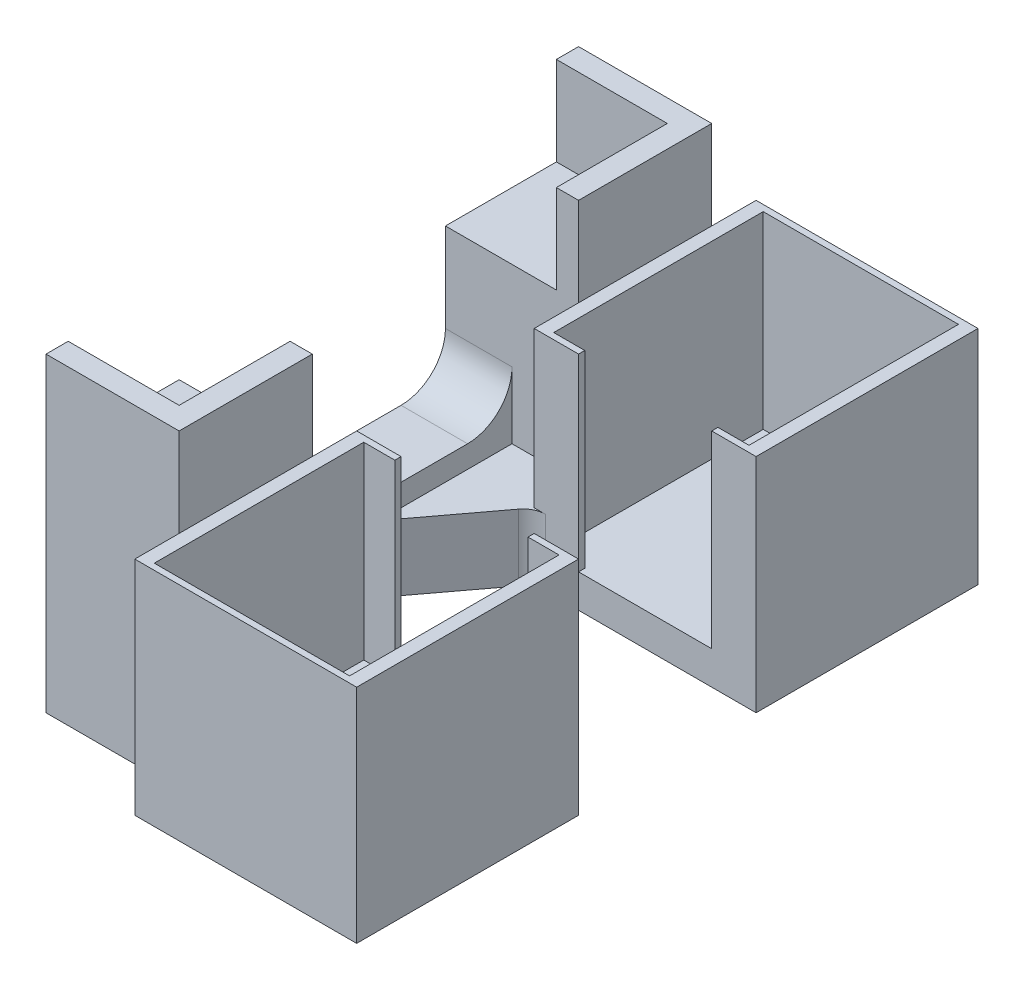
ISO-10303-21;
HEADER;
FILE_DESCRIPTION(('STEP AP214'),'2;1');
FILE_NAME('part.step','',(''),(''),'','','');
FILE_SCHEMA(('AUTOMOTIVE_DESIGN { 1 0 10303 214 1 1 1 1 }'));
ENDSEC;
DATA;
#1=APPLICATION_CONTEXT('core data for automotive mechanical design processes');
#2=APPLICATION_PROTOCOL_DEFINITION('international standard','automotive_design',2000,#1);
#3=PRODUCT_CONTEXT('',#1,'mechanical');
#4=PRODUCT('Part','Part','',(#3));
#5=PRODUCT_RELATED_PRODUCT_CATEGORY('part','',(#4));
#6=PRODUCT_DEFINITION_FORMATION('','',#4);
#7=PRODUCT_DEFINITION_CONTEXT('part definition',#1,'design');
#8=PRODUCT_DEFINITION('design','',#6,#7);
#9=PRODUCT_DEFINITION_SHAPE('','',#8);
#10=(LENGTH_UNIT() NAMED_UNIT(*) SI_UNIT(.MILLI.,.METRE.));
#11=(NAMED_UNIT(*) PLANE_ANGLE_UNIT() SI_UNIT($,.RADIAN.));
#12=(NAMED_UNIT(*) SI_UNIT($,.STERADIAN.) SOLID_ANGLE_UNIT());
#13=UNCERTAINTY_MEASURE_WITH_UNIT(LENGTH_MEASURE(1.E-05),#10,'distance_accuracy_value','');
#14=(GEOMETRIC_REPRESENTATION_CONTEXT(3) GLOBAL_UNCERTAINTY_ASSIGNED_CONTEXT((#13)) GLOBAL_UNIT_ASSIGNED_CONTEXT((#10,
#11,#12)) REPRESENTATION_CONTEXT('',''));
#15=CARTESIAN_POINT('',(0.,0.,0.));
#16=DIRECTION('',(0.,0.,1.));
#17=DIRECTION('',(1.,0.,0.));
#18=AXIS2_PLACEMENT_3D('',#15,#16,#17);
#19=CARTESIAN_POINT('',(-25.,25.,90.));
#20=DIRECTION('',(0.,-1.,0.));
#21=DIRECTION('',(0.,0.,1.));
#22=AXIS2_PLACEMENT_3D('',#19,#20,#21);
#23=PLANE('',#22);
#24=DIRECTION('',(0.,0.,1.));
#25=VECTOR('',#24,1.);
#26=CARTESIAN_POINT('',(-25.,25.,130.));
#27=LINE('',#26,#25);
#28=CARTESIAN_POINT('',(-25.,25.,100.));
#29=VERTEX_POINT('',#28);
#30=CARTESIAN_POINT('',(-25.,25.,130.));
#31=VERTEX_POINT('',#30);
#32=EDGE_CURVE('E283',#29,#31,#27,.T.);
#33=ORIENTED_EDGE('',*,*,#32,.T.);
#34=DIRECTION('',(0.,0.,1.));
#35=VECTOR('',#34,1.);
#36=CARTESIAN_POINT('',(-25.,25.,90.));
#37=LINE('',#36,#35);
#38=CARTESIAN_POINT('',(-25.,25.,140.));
#39=VERTEX_POINT('',#38);
#40=EDGE_CURVE('E476',#31,#39,#37,.T.);
#41=ORIENTED_EDGE('',*,*,#40,.T.);
#42=DIRECTION('',(-1.,0.,0.));
#43=VECTOR('',#42,1.);
#44=CARTESIAN_POINT('',(-25.,25.,140.));
#45=LINE('',#44,#43);
#46=CARTESIAN_POINT('',(25.,25.,140.));
#47=VERTEX_POINT('',#46);
#48=EDGE_CURVE('E464',#47,#39,#45,.T.);
#49=ORIENTED_EDGE('',*,*,#48,.F.);
#50=DIRECTION('',(0.,0.,1.));
#51=VECTOR('',#50,1.);
#52=CARTESIAN_POINT('',(25.,25.,90.));
#53=LINE('',#52,#51);
#54=CARTESIAN_POINT('',(25.,25.,90.));
#55=VERTEX_POINT('',#54);
#56=EDGE_CURVE('E480',#55,#47,#53,.T.);
#57=ORIENTED_EDGE('',*,*,#56,.F.);
#58=DIRECTION('',(-1.,0.,0.));
#59=VECTOR('',#58,1.);
#60=CARTESIAN_POINT('',(-25.,25.,90.));
#61=LINE('',#60,#59);
#62=CARTESIAN_POINT('',(15.,25.,90.));
#63=VERTEX_POINT('',#62);
#64=EDGE_CURVE('E453',#55,#63,#61,.T.);
#65=ORIENTED_EDGE('',*,*,#64,.T.);
#66=DIRECTION('',(0.,0.,-1.));
#67=VECTOR('',#66,1.);
#68=CARTESIAN_POINT('',(15.,25.,91.4));
#69=LINE('',#68,#67);
#70=CARTESIAN_POINT('',(15.,25.,91.4));
#71=VERTEX_POINT('',#70);
#72=EDGE_CURVE('E419',#71,#63,#69,.T.);
#73=ORIENTED_EDGE('',*,*,#72,.F.);
#74=DIRECTION('',(1.,0.,0.));
#75=VECTOR('',#74,1.);
#76=CARTESIAN_POINT('',(15.,25.,91.4));
#77=LINE('',#76,#75);
#78=CARTESIAN_POINT('',(22.,25.,91.4));
#79=VERTEX_POINT('',#78);
#80=EDGE_CURVE('E422',#71,#79,#77,.T.);
#81=ORIENTED_EDGE('',*,*,#80,.T.);
#82=DIRECTION('',(0.,0.,1.));
#83=VECTOR('',#82,1.);
#84=CARTESIAN_POINT('',(22.,25.,91.4));
#85=LINE('',#84,#83);
#86=CARTESIAN_POINT('',(22.,25.,138.6));
#87=VERTEX_POINT('',#86);
#88=EDGE_CURVE('E425',#79,#87,#85,.T.);
#89=ORIENTED_EDGE('',*,*,#88,.T.);
#90=DIRECTION('',(1.,0.,0.));
#91=VECTOR('',#90,1.);
#92=CARTESIAN_POINT('',(-22.,25.,138.6));
#93=LINE('',#92,#91);
#94=CARTESIAN_POINT('',(-22.,25.,138.6));
#95=VERTEX_POINT('',#94);
#96=EDGE_CURVE('E428',#95,#87,#93,.T.);
#97=ORIENTED_EDGE('',*,*,#96,.F.);
#98=DIRECTION('',(0.,0.,1.));
#99=VECTOR('',#98,1.);
#100=CARTESIAN_POINT('',(-22.,25.,91.4));
#101=LINE('',#100,#99);
#102=CARTESIAN_POINT('',(-22.,25.,91.4));
#103=VERTEX_POINT('',#102);
#104=EDGE_CURVE('E396',#103,#95,#101,.T.);
#105=ORIENTED_EDGE('',*,*,#104,.F.);
#106=DIRECTION('',(1.,0.,0.));
#107=VECTOR('',#106,1.);
#108=CARTESIAN_POINT('',(-22.,25.,91.4));
#109=LINE('',#108,#107);
#110=CARTESIAN_POINT('',(-15.,25.,91.4));
#111=VERTEX_POINT('',#110);
#112=EDGE_CURVE('E391',#103,#111,#109,.T.);
#113=ORIENTED_EDGE('',*,*,#112,.T.);
#114=DIRECTION('',(0.,0.,-1.));
#115=VECTOR('',#114,1.);
#116=CARTESIAN_POINT('',(-15.,25.,91.4));
#117=LINE('',#116,#115);
#118=CARTESIAN_POINT('',(-15.,25.,90.));
#119=VERTEX_POINT('',#118);
#120=EDGE_CURVE('E416',#111,#119,#117,.T.);
#121=ORIENTED_EDGE('',*,*,#120,.T.);
#122=CARTESIAN_POINT('',(-25.,25.,90.));
#123=VERTEX_POINT('',#122);
#124=EDGE_CURVE('E451',#119,#123,#61,.T.);
#125=ORIENTED_EDGE('',*,*,#124,.T.);
#126=EDGE_CURVE('E477',#123,#29,#37,.T.);
#127=ORIENTED_EDGE('',*,*,#126,.T.);
#128=EDGE_LOOP('',(#33,#41,#49,#57,#65,#73,#81,#89,#97,#105,#113,#121,#125,#127));
#129=FACE_BOUND('',#128,.T.);
#130=ADVANCED_FACE('F53',(#129),#23,.F.);
#131=DIRECTION('',(0.,0.,-1.));
#132=VECTOR('',#131,1.);
#133=CARTESIAN_POINT('',(-30.,25.,100.));
#134=LINE('',#133,#132);
#135=CARTESIAN_POINT('',(-30.,25.,125.));
#136=VERTEX_POINT('',#135);
#137=CARTESIAN_POINT('',(-30.,25.,100.));
#138=VERTEX_POINT('',#137);
#139=EDGE_CURVE('E286',#136,#138,#134,.T.);
#140=ORIENTED_EDGE('',*,*,#139,.T.);
#141=DIRECTION('',(1.,0.,0.));
#142=VECTOR('',#141,1.);
#143=CARTESIAN_POINT('',(-55.,25.,100.));
#144=LINE('',#143,#142);
#145=CARTESIAN_POINT('',(-55.,25.,100.));
#146=VERTEX_POINT('',#145);
#147=EDGE_CURVE('E384',#146,#138,#144,.T.);
#148=ORIENTED_EDGE('',*,*,#147,.F.);
#149=DIRECTION('',(0.,0.,1.));
#150=VECTOR('',#149,1.);
#151=CARTESIAN_POINT('',(-55.,25.,130.));
#152=LINE('',#151,#150);
#153=CARTESIAN_POINT('',(-55.,25.,125.));
#154=VERTEX_POINT('',#153);
#155=EDGE_CURVE('E381',#146,#154,#152,.T.);
#156=ORIENTED_EDGE('',*,*,#155,.T.);
#157=DIRECTION('',(1.,0.,0.));
#158=VECTOR('',#157,1.);
#159=CARTESIAN_POINT('',(-30.,25.,125.));
#160=LINE('',#159,#158);
#161=EDGE_CURVE('E297',#154,#136,#160,.T.);
#162=ORIENTED_EDGE('',*,*,#161,.T.);
#163=EDGE_LOOP('',(#140,#148,#156,#162));
#164=FACE_BOUND('',#163,.T.);
#165=ADVANCED_FACE('F583',(#164),#23,.F.);
#166=CARTESIAN_POINT('',(-55.,25.,100.));
#167=DIRECTION('',(0.,0.,1.));
#168=DIRECTION('',(0.,1.,0.));
#169=AXIS2_PLACEMENT_3D('',#166,#167,#168);
#170=PLANE('',#169);
#171=DIRECTION('',(-1.,0.,0.));
#172=VECTOR('',#171,1.);
#173=CARTESIAN_POINT('',(-25.,-10.,100.));
#174=LINE('',#173,#172);
#175=CARTESIAN_POINT('',(-25.,-10.,100.));
#176=VERTEX_POINT('',#175);
#177=CARTESIAN_POINT('',(-40.,-10.,100.));
#178=VERTEX_POINT('',#177);
#179=EDGE_CURVE('E318',#176,#178,#174,.T.);
#180=ORIENTED_EDGE('',*,*,#179,.T.);
#181=DIRECTION('',(0.,-1.,0.));
#182=VECTOR('',#181,1.);
#183=CARTESIAN_POINT('',(-40.,-25.,100.));
#184=LINE('',#183,#182);
#185=CARTESIAN_POINT('',(-40.,5.,100.));
#186=VERTEX_POINT('',#185);
#187=EDGE_CURVE('E336',#186,#178,#184,.T.);
#188=ORIENTED_EDGE('',*,*,#187,.F.);
#189=DIRECTION('',(-1.,0.,0.));
#190=VECTOR('',#189,1.);
#191=CARTESIAN_POINT('',(-55.,5.,100.));
#192=LINE('',#191,#190);
#193=CARTESIAN_POINT('',(-55.,5.,100.));
#194=VERTEX_POINT('',#193);
#195=EDGE_CURVE('E485',#194,#186,#192,.F.);
#196=ORIENTED_EDGE('',*,*,#195,.F.);
#197=DIRECTION('',(0.,1.,0.));
#198=VECTOR('',#197,1.);
#199=CARTESIAN_POINT('',(-55.,25.,100.));
#200=LINE('',#199,#198);
#201=EDGE_CURVE('E379',#194,#146,#200,.T.);
#202=ORIENTED_EDGE('',*,*,#201,.T.);
#203=ORIENTED_EDGE('',*,*,#147,.T.);
#204=DIRECTION('',(0.,-1.,0.));
#205=VECTOR('',#204,1.);
#206=CARTESIAN_POINT('',(-30.,45.,100.));
#207=LINE('',#206,#205);
#208=CARTESIAN_POINT('',(-30.,45.,100.));
#209=VERTEX_POINT('',#208);
#210=EDGE_CURVE('E68',#209,#138,#207,.T.);
#211=ORIENTED_EDGE('',*,*,#210,.F.);
#212=DIRECTION('',(1.,0.,0.));
#213=VECTOR('',#212,1.);
#214=CARTESIAN_POINT('',(-25.,45.,100.));
#215=LINE('',#214,#213);
#216=CARTESIAN_POINT('',(-25.,45.,100.));
#217=VERTEX_POINT('',#216);
#218=EDGE_CURVE('E292',#209,#217,#215,.T.);
#219=ORIENTED_EDGE('',*,*,#218,.T.);
#220=DIRECTION('',(0.,-1.,0.));
#221=VECTOR('',#220,1.);
#222=CARTESIAN_POINT('',(-25.,45.,100.));
#223=LINE('',#222,#221);
#224=EDGE_CURVE('E303',#217,#29,#223,.T.);
#225=ORIENTED_EDGE('',*,*,#224,.T.);
#226=DIRECTION('',(0.,1.,0.));
#227=VECTOR('',#226,1.);
#228=CARTESIAN_POINT('',(-25.,25.,100.));
#229=LINE('',#228,#227);
#230=EDGE_CURVE('E278',#176,#29,#229,.T.);
#231=ORIENTED_EDGE('',*,*,#230,.F.);
#232=EDGE_LOOP('',(#180,#188,#196,#202,#203,#211,#219,#225,#231));
#233=FACE_BOUND('',#232,.T.);
#234=ADVANCED_FACE('F538',(#233),#170,.F.);
#235=CARTESIAN_POINT('',(-25.,-25.,90.));
#236=DIRECTION('',(1.,0.,0.));
#237=DIRECTION('',(0.,0.,1.));
#238=AXIS2_PLACEMENT_3D('',#235,#236,#237);
#239=PLANE('',#238);
#240=DIRECTION('',(0.,0.,1.));
#241=VECTOR('',#240,1.);
#242=CARTESIAN_POINT('',(-25.,-10.,90.));
#243=LINE('',#242,#241);
#244=CARTESIAN_POINT('',(-25.,-10.,90.));
#245=VERTEX_POINT('',#244);
#246=EDGE_CURVE('E316',#245,#176,#243,.T.);
#247=ORIENTED_EDGE('',*,*,#246,.T.);
#248=ORIENTED_EDGE('',*,*,#230,.T.);
#249=ORIENTED_EDGE('',*,*,#126,.F.);
#250=DIRECTION('',(0.,-1.,0.));
#251=VECTOR('',#250,1.);
#252=CARTESIAN_POINT('',(-25.,-25.,90.));
#253=LINE('',#252,#251);
#254=EDGE_CURVE('E456',#123,#245,#253,.T.);
#255=ORIENTED_EDGE('',*,*,#254,.T.);
#256=EDGE_LOOP('',(#247,#248,#249,#255));
#257=FACE_BOUND('',#256,.T.);
#258=ADVANCED_FACE('F542',(#257),#239,.F.);
#259=CARTESIAN_POINT('',(-40.,0.,140.));
#260=DIRECTION('',(1.,0.,0.));
#261=DIRECTION('',(0.,0.,1.));
#262=AXIS2_PLACEMENT_3D('',#259,#260,#261);
#263=PLANE('',#262);
#264=DIRECTION('',(0.,1.,0.));
#265=VECTOR('',#264,1.);
#266=CARTESIAN_POINT('',(-40.,-25.,70.));
#267=LINE('',#266,#265);
#268=CARTESIAN_POINT('',(-40.,-10.,70.));
#269=VERTEX_POINT('',#268);
#270=CARTESIAN_POINT('',(-40.,-5.,70.));
#271=VERTEX_POINT('',#270);
#272=EDGE_CURVE('E341',#269,#271,#267,.T.);
#273=ORIENTED_EDGE('',*,*,#272,.T.);
#274=DIRECTION('',(0.,0.,1.));
#275=VECTOR('',#274,1.);
#276=CARTESIAN_POINT('',(-40.,-5.,100.));
#277=LINE('',#276,#275);
#278=CARTESIAN_POINT('',(-40.,-5.,90.));
#279=VERTEX_POINT('',#278);
#280=EDGE_CURVE('E329',#271,#279,#277,.T.);
#281=ORIENTED_EDGE('',*,*,#280,.T.);
#282=CARTESIAN_POINT('',(-40.,5.,90.));
#283=DIRECTION('',(-1.,0.,0.));
#284=DIRECTION('',(0.,0.,1.));
#285=AXIS2_PLACEMENT_3D('',#282,#283,#284);
#286=CIRCLE('',#285,10.);
#287=EDGE_CURVE('E490',#186,#279,#286,.F.);
#288=ORIENTED_EDGE('',*,*,#287,.F.);
#289=ORIENTED_EDGE('',*,*,#187,.T.);
#290=DIRECTION('',(0.,0.,-1.));
#291=VECTOR('',#290,1.);
#292=CARTESIAN_POINT('',(-40.,-10.,100.));
#293=LINE('',#292,#291);
#294=EDGE_CURVE('E310',#178,#269,#293,.T.);
#295=ORIENTED_EDGE('',*,*,#294,.T.);
#296=EDGE_LOOP('',(#273,#281,#288,#289,#295));
#297=FACE_BOUND('',#296,.T.);
#298=ADVANCED_FACE('F534',(#297),#263,.T.);
#299=DIRECTION('',(0.,-1.,0.));
#300=VECTOR('',#299,1.);
#301=CARTESIAN_POINT('',(-25.,25.,130.));
#302=LINE('',#301,#300);
#303=CARTESIAN_POINT('',(-25.,-25.,130.));
#304=VERTEX_POINT('',#303);
#305=EDGE_CURVE('E376',#31,#304,#302,.T.);
#306=ORIENTED_EDGE('',*,*,#305,.T.);
#307=DIRECTION('',(0.,0.,1.));
#308=VECTOR('',#307,1.);
#309=CARTESIAN_POINT('',(-25.,-25.,90.));
#310=LINE('',#309,#308);
#311=CARTESIAN_POINT('',(-25.,-25.,140.));
#312=VERTEX_POINT('',#311);
#313=EDGE_CURVE('E473',#304,#312,#310,.T.);
#314=ORIENTED_EDGE('',*,*,#313,.T.);
#315=DIRECTION('',(0.,-1.,0.));
#316=VECTOR('',#315,1.);
#317=CARTESIAN_POINT('',(-25.,-25.,140.));
#318=LINE('',#317,#316);
#319=EDGE_CURVE('E467',#39,#312,#318,.T.);
#320=ORIENTED_EDGE('',*,*,#319,.F.);
#321=ORIENTED_EDGE('',*,*,#40,.F.);
#322=EDGE_LOOP('',(#306,#314,#320,#321));
#323=FACE_BOUND('',#322,.T.);
#324=ADVANCED_FACE('F574',(#323),#239,.F.);
#325=CARTESIAN_POINT('',(0.,0.,90.));
#326=DIRECTION('',(0.,0.,1.));
#327=DIRECTION('',(-1.,0.,0.));
#328=AXIS2_PLACEMENT_3D('',#325,#326,#327);
#329=PLANE('',#328);
#330=ORIENTED_EDGE('',*,*,#254,.F.);
#331=ORIENTED_EDGE('',*,*,#124,.F.);
#332=DIRECTION('',(0.,1.,0.));
#333=VECTOR('',#332,1.);
#334=CARTESIAN_POINT('',(-15.,-17.5,90.));
#335=LINE('',#334,#333);
#336=CARTESIAN_POINT('',(-15.,-17.5,90.));
#337=VERTEX_POINT('',#336);
#338=EDGE_CURVE('E446',#337,#119,#335,.T.);
#339=ORIENTED_EDGE('',*,*,#338,.F.);
#340=DIRECTION('',(1.,0.,0.));
#341=VECTOR('',#340,1.);
#342=CARTESIAN_POINT('',(-15.,-17.5,90.));
#343=LINE('',#342,#341);
#344=CARTESIAN_POINT('',(15.,-17.5,90.));
#345=VERTEX_POINT('',#344);
#346=EDGE_CURVE('E398',#337,#345,#343,.T.);
#347=ORIENTED_EDGE('',*,*,#346,.T.);
#348=DIRECTION('',(0.,1.,0.));
#349=VECTOR('',#348,1.);
#350=CARTESIAN_POINT('',(15.,-17.5,90.));
#351=LINE('',#350,#349);
#352=EDGE_CURVE('E444',#345,#63,#351,.T.);
#353=ORIENTED_EDGE('',*,*,#352,.T.);
#354=ORIENTED_EDGE('',*,*,#64,.F.);
#355=DIRECTION('',(0.,1.,0.));
#356=VECTOR('',#355,1.);
#357=CARTESIAN_POINT('',(25.,-25.,90.));
#358=LINE('',#357,#356);
#359=CARTESIAN_POINT('',(25.,-25.,90.));
#360=VERTEX_POINT('',#359);
#361=EDGE_CURVE('E449',#360,#55,#358,.T.);
#362=ORIENTED_EDGE('',*,*,#361,.F.);
#363=DIRECTION('',(1.,0.,0.));
#364=VECTOR('',#363,1.);
#365=CARTESIAN_POINT('',(-25.,-25.,90.));
#366=LINE('',#365,#364);
#367=CARTESIAN_POINT('',(-22.5,-25.,90.));
#368=VERTEX_POINT('',#367);
#369=EDGE_CURVE('E459',#368,#360,#366,.T.);
#370=ORIENTED_EDGE('',*,*,#369,.F.);
#371=DIRECTION('',(0.,1.,0.));
#372=VECTOR('',#371,1.);
#373=CARTESIAN_POINT('',(-22.5,0.,90.));
#374=LINE('',#373,#372);
#375=CARTESIAN_POINT('',(-22.5,-10.,90.));
#376=VERTEX_POINT('',#375);
#377=EDGE_CURVE('E506',#376,#368,#374,.F.);
#378=ORIENTED_EDGE('',*,*,#377,.F.);
#379=DIRECTION('',(1.,0.,0.));
#380=VECTOR('',#379,1.);
#381=CARTESIAN_POINT('',(0.,-10.,90.));
#382=LINE('',#381,#380);
#383=EDGE_CURVE('E509',#245,#376,#382,.T.);
#384=ORIENTED_EDGE('',*,*,#383,.F.);
#385=EDGE_LOOP('',(#330,#331,#339,#347,#353,#354,#362,#370,#378,#384));
#386=FACE_BOUND('',#385,.T.);
#387=ADVANCED_FACE('F519',(#386),#329,.F.);
#388=CARTESIAN_POINT('',(25.,-25.,90.));
#389=DIRECTION('',(-1.,0.,0.));
#390=DIRECTION('',(0.,0.,-1.));
#391=AXIS2_PLACEMENT_3D('',#388,#389,#390);
#392=PLANE('',#391);
#393=DIRECTION('',(0.,1.,0.));
#394=VECTOR('',#393,1.);
#395=CARTESIAN_POINT('',(25.,-25.,140.));
#396=LINE('',#395,#394);
#397=CARTESIAN_POINT('',(25.,-25.,140.));
#398=VERTEX_POINT('',#397);
#399=EDGE_CURVE('E435',#398,#47,#396,.T.);
#400=ORIENTED_EDGE('',*,*,#399,.F.);
#401=DIRECTION('',(0.,0.,1.));
#402=VECTOR('',#401,1.);
#403=CARTESIAN_POINT('',(25.,-25.,90.));
#404=LINE('',#403,#402);
#405=EDGE_CURVE('E462',#360,#398,#404,.T.);
#406=ORIENTED_EDGE('',*,*,#405,.F.);
#407=ORIENTED_EDGE('',*,*,#361,.T.);
#408=ORIENTED_EDGE('',*,*,#56,.T.);
#409=EDGE_LOOP('',(#400,#406,#407,#408));
#410=FACE_BOUND('',#409,.T.);
#411=ADVANCED_FACE('F568',(#410),#392,.F.);
#412=CARTESIAN_POINT('',(-25.,-25.,90.));
#413=DIRECTION('',(0.,1.,0.));
#414=DIRECTION('',(0.,0.,-1.));
#415=AXIS2_PLACEMENT_3D('',#412,#413,#414);
#416=PLANE('',#415);
#417=DIRECTION('',(1.,0.,0.));
#418=VECTOR('',#417,1.);
#419=CARTESIAN_POINT('',(-50.,-25.,125.));
#420=LINE('',#419,#418);
#421=CARTESIAN_POINT('',(-50.,-25.,125.));
#422=VERTEX_POINT('',#421);
#423=CARTESIAN_POINT('',(-30.,-25.,125.));
#424=VERTEX_POINT('',#423);
#425=EDGE_CURVE('E360',#422,#424,#420,.T.);
#426=ORIENTED_EDGE('',*,*,#425,.T.);
#427=DIRECTION('',(0.,0.,1.));
#428=VECTOR('',#427,1.);
#429=CARTESIAN_POINT('',(-30.,-25.,105.));
#430=LINE('',#429,#428);
#431=CARTESIAN_POINT('',(-30.,-25.,105.));
#432=VERTEX_POINT('',#431);
#433=EDGE_CURVE('E363',#432,#424,#430,.T.);
#434=ORIENTED_EDGE('',*,*,#433,.F.);
#435=DIRECTION('',(1.,0.,0.));
#436=VECTOR('',#435,1.);
#437=CARTESIAN_POINT('',(-50.,-25.,105.));
#438=LINE('',#437,#436);
#439=CARTESIAN_POINT('',(-50.,-25.,105.));
#440=VERTEX_POINT('',#439);
#441=EDGE_CURVE('E366',#440,#432,#438,.T.);
#442=ORIENTED_EDGE('',*,*,#441,.F.);
#443=DIRECTION('',(0.,0.,1.));
#444=VECTOR('',#443,1.);
#445=CARTESIAN_POINT('',(-50.,-25.,105.));
#446=LINE('',#445,#444);
#447=EDGE_CURVE('E348',#440,#422,#446,.T.);
#448=ORIENTED_EDGE('',*,*,#447,.T.);
#449=EDGE_LOOP('',(#426,#434,#442,#448));
#450=FACE_BOUND('',#449,.T.);
#451=DIRECTION('',(-1.,0.,0.));
#452=VECTOR('',#451,1.);
#453=CARTESIAN_POINT('',(-40.,-25.,70.));
#454=LINE('',#453,#452);
#455=CARTESIAN_POINT('',(-40.,-25.,70.));
#456=VERTEX_POINT('',#455);
#457=CARTESIAN_POINT('',(-53.,-25.,70.));
#458=VERTEX_POINT('',#457);
#459=EDGE_CURVE('E345',#456,#458,#454,.T.);
#460=ORIENTED_EDGE('',*,*,#459,.F.);
#461=DIRECTION('',(-0.6,0.,-0.8));
#462=VECTOR('',#461,1.);
#463=CARTESIAN_POINT('',(-40.,-25.,70.));
#464=LINE('',#463,#462);
#465=CARTESIAN_POINT('',(-26.5,-25.,88.));
#466=VERTEX_POINT('',#465);
#467=EDGE_CURVE('E321',#466,#456,#464,.T.);
#468=ORIENTED_EDGE('',*,*,#467,.F.);
#469=CARTESIAN_POINT('',(-22.5,-25.,85.));
#470=DIRECTION('',(0.,-1.,0.));
#471=DIRECTION('',(0.,0.,-1.));
#472=AXIS2_PLACEMENT_3D('',#469,#470,#471);
#473=CIRCLE('',#472,5.);
#474=EDGE_CURVE('E13',#368,#466,#473,.T.);
#475=ORIENTED_EDGE('',*,*,#474,.F.);
#476=ORIENTED_EDGE('',*,*,#369,.T.);
#477=ORIENTED_EDGE('',*,*,#405,.T.);
#478=DIRECTION('',(1.,0.,0.));
#479=VECTOR('',#478,1.);
#480=CARTESIAN_POINT('',(-25.,-25.,140.));
#481=LINE('',#480,#479);
#482=EDGE_CURVE('E452',#312,#398,#481,.T.);
#483=ORIENTED_EDGE('',*,*,#482,.F.);
#484=ORIENTED_EDGE('',*,*,#313,.F.);
#485=DIRECTION('',(1.,0.,0.));
#486=VECTOR('',#485,1.);
#487=CARTESIAN_POINT('',(-55.,-25.,130.));
#488=LINE('',#487,#486);
#489=CARTESIAN_POINT('',(-55.,-25.,130.));
#490=VERTEX_POINT('',#489);
#491=EDGE_CURVE('E389',#490,#304,#488,.T.);
#492=ORIENTED_EDGE('',*,*,#491,.F.);
#493=DIRECTION('',(0.,0.,-1.));
#494=VECTOR('',#493,1.);
#495=CARTESIAN_POINT('',(-55.,-25.,130.));
#496=LINE('',#495,#494);
#497=CARTESIAN_POINT('',(-55.,-25.,72.));
#498=VERTEX_POINT('',#497);
#499=EDGE_CURVE('E275',#490,#498,#496,.T.);
#500=ORIENTED_EDGE('',*,*,#499,.T.);
#501=CARTESIAN_POINT('',(-53.,-25.,72.));
#502=DIRECTION('',(0.,-1.,0.));
#503=DIRECTION('',(0.,0.,-1.));
#504=AXIS2_PLACEMENT_3D('',#501,#502,#503);
#505=CIRCLE('',#504,2.);
#506=EDGE_CURVE('E500',#458,#498,#505,.F.);
#507=ORIENTED_EDGE('',*,*,#506,.F.);
#508=EDGE_LOOP('',(#460,#468,#475,#476,#477,#483,#484,#492,#500,#507));
#509=FACE_BOUND('',#508,.T.);
#510=ADVANCED_FACE('F524',(#450,#509),#416,.F.);
#511=CARTESIAN_POINT('',(0.,0.,140.));
#512=DIRECTION('',(0.,0.,1.));
#513=DIRECTION('',(-1.,0.,0.));
#514=AXIS2_PLACEMENT_3D('',#511,#512,#513);
#515=PLANE('',#514);
#516=ORIENTED_EDGE('',*,*,#399,.T.);
#517=ORIENTED_EDGE('',*,*,#48,.T.);
#518=ORIENTED_EDGE('',*,*,#319,.T.);
#519=ORIENTED_EDGE('',*,*,#482,.T.);
#520=EDGE_LOOP('',(#516,#517,#518,#519));
#521=FACE_BOUND('',#520,.T.);
#522=ADVANCED_FACE('F570',(#521),#515,.T.);
#523=CARTESIAN_POINT('',(-22.,-17.5,91.4));
#524=DIRECTION('',(0.,0.,-1.));
#525=DIRECTION('',(1.,0.,0.));
#526=AXIS2_PLACEMENT_3D('',#523,#524,#525);
#527=PLANE('',#526);
#528=ORIENTED_EDGE('',*,*,#112,.F.);
#529=DIRECTION('',(0.,1.,0.));
#530=VECTOR('',#529,1.);
#531=CARTESIAN_POINT('',(-22.,-17.5,91.4));
#532=LINE('',#531,#530);
#533=CARTESIAN_POINT('',(-22.,-17.5,91.4));
#534=VERTEX_POINT('',#533);
#535=EDGE_CURVE('E433',#534,#103,#532,.T.);
#536=ORIENTED_EDGE('',*,*,#535,.F.);
#537=DIRECTION('',(1.,0.,0.));
#538=VECTOR('',#537,1.);
#539=CARTESIAN_POINT('',(-22.,-17.5,91.4));
#540=LINE('',#539,#538);
#541=CARTESIAN_POINT('',(-15.,-17.5,91.4));
#542=VERTEX_POINT('',#541);
#543=EDGE_CURVE('E392',#534,#542,#540,.T.);
#544=ORIENTED_EDGE('',*,*,#543,.T.);
#545=DIRECTION('',(0.,1.,0.));
#546=VECTOR('',#545,1.);
#547=CARTESIAN_POINT('',(-15.,-17.5,91.4));
#548=LINE('',#547,#546);
#549=EDGE_CURVE('E413',#542,#111,#548,.T.);
#550=ORIENTED_EDGE('',*,*,#549,.T.);
#551=EDGE_LOOP('',(#528,#536,#544,#550));
#552=FACE_BOUND('',#551,.T.);
#553=ADVANCED_FACE('F663',(#552),#527,.F.);
#554=CARTESIAN_POINT('',(-22.,-17.5,91.4));
#555=DIRECTION('',(1.,0.,0.));
#556=DIRECTION('',(0.,0.,1.));
#557=AXIS2_PLACEMENT_3D('',#554,#555,#556);
#558=PLANE('',#557);
#559=ORIENTED_EDGE('',*,*,#104,.T.);
#560=DIRECTION('',(0.,1.,0.));
#561=VECTOR('',#560,1.);
#562=CARTESIAN_POINT('',(-22.,-17.5,138.6));
#563=LINE('',#562,#561);
#564=CARTESIAN_POINT('',(-22.,-17.5,138.6));
#565=VERTEX_POINT('',#564);
#566=EDGE_CURVE('E436',#565,#95,#563,.T.);
#567=ORIENTED_EDGE('',*,*,#566,.F.);
#568=DIRECTION('',(0.,0.,1.));
#569=VECTOR('',#568,1.);
#570=CARTESIAN_POINT('',(-22.,-17.5,91.4));
#571=LINE('',#570,#569);
#572=EDGE_CURVE('E410',#534,#565,#571,.T.);
#573=ORIENTED_EDGE('',*,*,#572,.F.);
#574=ORIENTED_EDGE('',*,*,#535,.T.);
#575=EDGE_LOOP('',(#559,#567,#573,#574));
#576=FACE_BOUND('',#575,.T.);
#577=ADVANCED_FACE('F659',(#576),#558,.T.);
#578=CARTESIAN_POINT('',(-22.,-17.5,138.6));
#579=DIRECTION('',(0.,0.,-1.));
#580=DIRECTION('',(1.,0.,0.));
#581=AXIS2_PLACEMENT_3D('',#578,#579,#580);
#582=PLANE('',#581);
#583=ORIENTED_EDGE('',*,*,#96,.T.);
#584=DIRECTION('',(0.,1.,0.));
#585=VECTOR('',#584,1.);
#586=CARTESIAN_POINT('',(22.,-17.5,138.6));
#587=LINE('',#586,#585);
#588=CARTESIAN_POINT('',(22.,-17.5,138.6));
#589=VERTEX_POINT('',#588);
#590=EDGE_CURVE('E438',#589,#87,#587,.T.);
#591=ORIENTED_EDGE('',*,*,#590,.F.);
#592=DIRECTION('',(1.,0.,0.));
#593=VECTOR('',#592,1.);
#594=CARTESIAN_POINT('',(-22.,-17.5,138.6));
#595=LINE('',#594,#593);
#596=EDGE_CURVE('E407',#565,#589,#595,.T.);
#597=ORIENTED_EDGE('',*,*,#596,.F.);
#598=ORIENTED_EDGE('',*,*,#566,.T.);
#599=EDGE_LOOP('',(#583,#591,#597,#598));
#600=FACE_BOUND('',#599,.T.);
#601=ADVANCED_FACE('F662',(#600),#582,.T.);
#602=CARTESIAN_POINT('',(22.,-17.5,91.4));
#603=DIRECTION('',(1.,0.,0.));
#604=DIRECTION('',(0.,0.,1.));
#605=AXIS2_PLACEMENT_3D('',#602,#603,#604);
#606=PLANE('',#605);
#607=ORIENTED_EDGE('',*,*,#88,.F.);
#608=DIRECTION('',(0.,1.,0.));
#609=VECTOR('',#608,1.);
#610=CARTESIAN_POINT('',(22.,-17.5,91.4));
#611=LINE('',#610,#609);
#612=CARTESIAN_POINT('',(22.,-17.5,91.4));
#613=VERTEX_POINT('',#612);
#614=EDGE_CURVE('E440',#613,#79,#611,.T.);
#615=ORIENTED_EDGE('',*,*,#614,.F.);
#616=DIRECTION('',(0.,0.,1.));
#617=VECTOR('',#616,1.);
#618=CARTESIAN_POINT('',(22.,-17.5,91.4));
#619=LINE('',#618,#617);
#620=EDGE_CURVE('E405',#613,#589,#619,.T.);
#621=ORIENTED_EDGE('',*,*,#620,.T.);
#622=ORIENTED_EDGE('',*,*,#590,.T.);
#623=EDGE_LOOP('',(#607,#615,#621,#622));
#624=FACE_BOUND('',#623,.T.);
#625=ADVANCED_FACE('F667',(#624),#606,.F.);
#626=CARTESIAN_POINT('',(15.,-17.5,91.4));
#627=DIRECTION('',(0.,0.,-1.));
#628=DIRECTION('',(1.,0.,0.));
#629=AXIS2_PLACEMENT_3D('',#626,#627,#628);
#630=PLANE('',#629);
#631=ORIENTED_EDGE('',*,*,#80,.F.);
#632=DIRECTION('',(0.,1.,0.));
#633=VECTOR('',#632,1.);
#634=CARTESIAN_POINT('',(15.,-17.5,91.4));
#635=LINE('',#634,#633);
#636=CARTESIAN_POINT('',(15.,-17.5,91.4));
#637=VERTEX_POINT('',#636);
#638=EDGE_CURVE('E442',#637,#71,#635,.T.);
#639=ORIENTED_EDGE('',*,*,#638,.F.);
#640=DIRECTION('',(1.,0.,0.));
#641=VECTOR('',#640,1.);
#642=CARTESIAN_POINT('',(15.,-17.5,91.4));
#643=LINE('',#642,#641);
#644=EDGE_CURVE('E403',#637,#613,#643,.T.);
#645=ORIENTED_EDGE('',*,*,#644,.T.);
#646=ORIENTED_EDGE('',*,*,#614,.T.);
#647=EDGE_LOOP('',(#631,#639,#645,#646));
#648=FACE_BOUND('',#647,.T.);
#649=ADVANCED_FACE('F671',(#648),#630,.F.);
#650=CARTESIAN_POINT('',(15.,-17.5,91.4));
#651=DIRECTION('',(-1.,0.,0.));
#652=DIRECTION('',(0.,0.,-1.));
#653=AXIS2_PLACEMENT_3D('',#650,#651,#652);
#654=PLANE('',#653);
#655=ORIENTED_EDGE('',*,*,#72,.T.);
#656=ORIENTED_EDGE('',*,*,#352,.F.);
#657=DIRECTION('',(0.,0.,-1.));
#658=VECTOR('',#657,1.);
#659=CARTESIAN_POINT('',(15.,-17.5,91.4));
#660=LINE('',#659,#658);
#661=EDGE_CURVE('E401',#637,#345,#660,.T.);
#662=ORIENTED_EDGE('',*,*,#661,.F.);
#663=ORIENTED_EDGE('',*,*,#638,.T.);
#664=EDGE_LOOP('',(#655,#656,#662,#663));
#665=FACE_BOUND('',#664,.T.);
#666=ADVANCED_FACE('F562',(#665),#654,.T.);
#667=CARTESIAN_POINT('',(-15.,-17.5,91.4));
#668=DIRECTION('',(-1.,0.,0.));
#669=DIRECTION('',(0.,0.,-1.));
#670=AXIS2_PLACEMENT_3D('',#667,#668,#669);
#671=PLANE('',#670);
#672=ORIENTED_EDGE('',*,*,#120,.F.);
#673=ORIENTED_EDGE('',*,*,#549,.F.);
#674=DIRECTION('',(0.,0.,-1.));
#675=VECTOR('',#674,1.);
#676=CARTESIAN_POINT('',(-15.,-17.5,91.4));
#677=LINE('',#676,#675);
#678=EDGE_CURVE('E395',#542,#337,#677,.T.);
#679=ORIENTED_EDGE('',*,*,#678,.T.);
#680=ORIENTED_EDGE('',*,*,#338,.T.);
#681=EDGE_LOOP('',(#672,#673,#679,#680));
#682=FACE_BOUND('',#681,.T.);
#683=ADVANCED_FACE('F552',(#682),#671,.F.);
#684=CARTESIAN_POINT('',(0.,-17.5,140.));
#685=DIRECTION('',(0.,-1.,0.));
#686=DIRECTION('',(0.,0.,1.));
#687=AXIS2_PLACEMENT_3D('',#684,#685,#686);
#688=PLANE('',#687);
#689=ORIENTED_EDGE('',*,*,#543,.F.);
#690=ORIENTED_EDGE('',*,*,#572,.T.);
#691=ORIENTED_EDGE('',*,*,#596,.T.);
#692=ORIENTED_EDGE('',*,*,#620,.F.);
#693=ORIENTED_EDGE('',*,*,#644,.F.);
#694=ORIENTED_EDGE('',*,*,#661,.T.);
#695=ORIENTED_EDGE('',*,*,#346,.F.);
#696=ORIENTED_EDGE('',*,*,#678,.F.);
#697=EDGE_LOOP('',(#689,#690,#691,#692,#693,#694,#695,#696));
#698=FACE_BOUND('',#697,.T.);
#699=ADVANCED_FACE('F556',(#698),#688,.F.);
#700=CARTESIAN_POINT('',(-55.,25.,130.));
#701=DIRECTION('',(0.,0.,-1.));
#702=DIRECTION('',(0.,-1.,0.));
#703=AXIS2_PLACEMENT_3D('',#700,#701,#702);
#704=PLANE('',#703);
#705=ORIENTED_EDGE('',*,*,#305,.F.);
#706=DIRECTION('',(0.,-1.,0.));
#707=VECTOR('',#706,1.);
#708=CARTESIAN_POINT('',(-25.,45.,130.));
#709=LINE('',#708,#707);
#710=CARTESIAN_POINT('',(-25.,45.,130.));
#711=VERTEX_POINT('',#710);
#712=EDGE_CURVE('E282',#711,#31,#709,.T.);
#713=ORIENTED_EDGE('',*,*,#712,.F.);
#714=DIRECTION('',(-1.,0.,0.));
#715=VECTOR('',#714,1.);
#716=CARTESIAN_POINT('',(-55.,45.,130.));
#717=LINE('',#716,#715);
#718=CARTESIAN_POINT('',(-55.,45.,130.));
#719=VERTEX_POINT('',#718);
#720=EDGE_CURVE('E265',#711,#719,#717,.T.);
#721=ORIENTED_EDGE('',*,*,#720,.T.);
#722=DIRECTION('',(0.,-1.,0.));
#723=VECTOR('',#722,1.);
#724=CARTESIAN_POINT('',(-55.,25.,130.));
#725=LINE('',#724,#723);
#726=EDGE_CURVE('E271',#719,#490,#725,.T.);
#727=ORIENTED_EDGE('',*,*,#726,.T.);
#728=ORIENTED_EDGE('',*,*,#491,.T.);
#729=EDGE_LOOP('',(#705,#713,#721,#727,#728));
#730=FACE_BOUND('',#729,.T.);
#731=ADVANCED_FACE('F281',(#730),#704,.F.);
#732=CARTESIAN_POINT('',(-55.,0.,140.));
#733=DIRECTION('',(-1.,0.,0.));
#734=DIRECTION('',(0.,0.,-1.));
#735=AXIS2_PLACEMENT_3D('',#732,#733,#734);
#736=PLANE('',#735);
#737=ORIENTED_EDGE('',*,*,#499,.F.);
#738=ORIENTED_EDGE('',*,*,#726,.F.);
#739=DIRECTION('',(0.,0.,-1.));
#740=VECTOR('',#739,1.);
#741=CARTESIAN_POINT('',(-55.,45.,125.));
#742=LINE('',#741,#740);
#743=CARTESIAN_POINT('',(-55.,45.,125.));
#744=VERTEX_POINT('',#743);
#745=EDGE_CURVE('E261',#719,#744,#742,.T.);
#746=ORIENTED_EDGE('',*,*,#745,.T.);
#747=DIRECTION('',(0.,-1.,0.));
#748=VECTOR('',#747,1.);
#749=CARTESIAN_POINT('',(-55.,45.,125.));
#750=LINE('',#749,#748);
#751=EDGE_CURVE('E76',#744,#154,#750,.T.);
#752=ORIENTED_EDGE('',*,*,#751,.T.);
#753=ORIENTED_EDGE('',*,*,#155,.F.);
#754=ORIENTED_EDGE('',*,*,#201,.F.);
#755=CARTESIAN_POINT('',(-55.,5.,90.));
#756=DIRECTION('',(1.,0.,0.));
#757=DIRECTION('',(0.,0.,-1.));
#758=AXIS2_PLACEMENT_3D('',#755,#756,#757);
#759=CIRCLE('',#758,10.);
#760=CARTESIAN_POINT('',(-55.,-5.,90.));
#761=VERTEX_POINT('',#760);
#762=EDGE_CURVE('E488',#761,#194,#759,.F.);
#763=ORIENTED_EDGE('',*,*,#762,.F.);
#764=DIRECTION('',(0.,0.,-1.));
#765=VECTOR('',#764,1.);
#766=CARTESIAN_POINT('',(-55.,-5.,100.));
#767=LINE('',#766,#765);
#768=CARTESIAN_POINT('',(-55.,-5.,72.));
#769=VERTEX_POINT('',#768);
#770=EDGE_CURVE('E324',#761,#769,#767,.T.);
#771=ORIENTED_EDGE('',*,*,#770,.T.);
#772=DIRECTION('',(0.,1.,0.));
#773=VECTOR('',#772,1.);
#774=CARTESIAN_POINT('',(-55.,0.,72.));
#775=LINE('',#774,#773);
#776=EDGE_CURVE('E493',#498,#769,#775,.T.);
#777=ORIENTED_EDGE('',*,*,#776,.F.);
#778=EDGE_LOOP('',(#737,#738,#746,#752,#753,#754,#763,#771,#777));
#779=FACE_BOUND('',#778,.T.);
#780=CARTESIAN_POINT('',(-55.,-15.,77.8));
#781=DIRECTION('',(1.,0.,0.));
#782=DIRECTION('',(0.,0.,-1.));
#783=AXIS2_PLACEMENT_3D('',#780,#781,#782);
#784=CIRCLE('',#783,4.05);
#785=CARTESIAN_POINT('',(-55.,-15.,73.75));
#786=VERTEX_POINT('',#785);
#787=EDGE_CURVE('E332',#786,#786,#784,.T.);
#788=ORIENTED_EDGE('',*,*,#787,.T.);
#789=EDGE_LOOP('',(#788));
#790=FACE_BOUND('',#789,.T.);
#791=ADVANCED_FACE('F272',(#779,#790),#736,.T.);
#792=CARTESIAN_POINT('',(-50.,53.2842712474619,105.));
#793=DIRECTION('',(-1.,0.,0.));
#794=DIRECTION('',(0.,0.,-1.));
#795=AXIS2_PLACEMENT_3D('',#792,#793,#794);
#796=PLANE('',#795);
#797=DIRECTION('',(0.,0.,-1.));
#798=VECTOR('',#797,1.);
#799=CARTESIAN_POINT('',(-50.,20.,105.));
#800=LINE('',#799,#798);
#801=CARTESIAN_POINT('',(-50.,20.,125.));
#802=VERTEX_POINT('',#801);
#803=CARTESIAN_POINT('',(-50.,20.,105.));
#804=VERTEX_POINT('',#803);
#805=EDGE_CURVE('E354',#802,#804,#800,.T.);
#806=ORIENTED_EDGE('',*,*,#805,.F.);
#807=DIRECTION('',(0.,-1.,0.));
#808=VECTOR('',#807,1.);
#809=CARTESIAN_POINT('',(-50.,53.2842712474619,125.));
#810=LINE('',#809,#808);
#811=EDGE_CURVE('E369',#802,#422,#810,.T.);
#812=ORIENTED_EDGE('',*,*,#811,.T.);
#813=ORIENTED_EDGE('',*,*,#447,.F.);
#814=DIRECTION('',(0.,-1.,0.));
#815=VECTOR('',#814,1.);
#816=CARTESIAN_POINT('',(-50.,53.2842712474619,105.));
#817=LINE('',#816,#815);
#818=EDGE_CURVE('E352',#804,#440,#817,.T.);
#819=ORIENTED_EDGE('',*,*,#818,.F.);
#820=EDGE_LOOP('',(#806,#812,#813,#819));
#821=FACE_BOUND('',#820,.T.);
#822=ADVANCED_FACE('F707',(#821),#796,.F.);
#823=CARTESIAN_POINT('',(-50.,53.2842712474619,105.));
#824=DIRECTION('',(0.,0.,1.));
#825=DIRECTION('',(-1.,0.,0.));
#826=AXIS2_PLACEMENT_3D('',#823,#824,#825);
#827=PLANE('',#826);
#828=DIRECTION('',(0.,-1.,0.));
#829=VECTOR('',#828,1.);
#830=CARTESIAN_POINT('',(-30.,53.2842712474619,105.));
#831=LINE('',#830,#829);
#832=CARTESIAN_POINT('',(-30.,20.,105.));
#833=VERTEX_POINT('',#832);
#834=EDGE_CURVE('E371',#833,#432,#831,.T.);
#835=ORIENTED_EDGE('',*,*,#834,.F.);
#836=DIRECTION('',(-1.,0.,0.));
#837=VECTOR('',#836,1.);
#838=CARTESIAN_POINT('',(-50.,20.,105.));
#839=LINE('',#838,#837);
#840=EDGE_CURVE('E351',#833,#804,#839,.T.);
#841=ORIENTED_EDGE('',*,*,#840,.T.);
#842=ORIENTED_EDGE('',*,*,#818,.T.);
#843=ORIENTED_EDGE('',*,*,#441,.T.);
#844=EDGE_LOOP('',(#835,#841,#842,#843));
#845=FACE_BOUND('',#844,.T.);
#846=ADVANCED_FACE('F704',(#845),#827,.T.);
#847=CARTESIAN_POINT('',(-30.,53.2842712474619,105.));
#848=DIRECTION('',(-1.,0.,0.));
#849=DIRECTION('',(0.,0.,-1.));
#850=AXIS2_PLACEMENT_3D('',#847,#848,#849);
#851=PLANE('',#850);
#852=DIRECTION('',(0.,-1.,0.));
#853=VECTOR('',#852,1.);
#854=CARTESIAN_POINT('',(-30.,53.2842712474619,125.));
#855=LINE('',#854,#853);
#856=CARTESIAN_POINT('',(-30.,20.,125.));
#857=VERTEX_POINT('',#856);
#858=EDGE_CURVE('E373',#857,#424,#855,.T.);
#859=ORIENTED_EDGE('',*,*,#858,.F.);
#860=DIRECTION('',(0.,0.,-1.));
#861=VECTOR('',#860,1.);
#862=CARTESIAN_POINT('',(-30.,20.,105.));
#863=LINE('',#862,#861);
#864=EDGE_CURVE('E349',#857,#833,#863,.T.);
#865=ORIENTED_EDGE('',*,*,#864,.T.);
#866=ORIENTED_EDGE('',*,*,#834,.T.);
#867=ORIENTED_EDGE('',*,*,#433,.T.);
#868=EDGE_LOOP('',(#859,#865,#866,#867));
#869=FACE_BOUND('',#868,.T.);
#870=ADVANCED_FACE('F700',(#869),#851,.T.);
#871=CARTESIAN_POINT('',(-50.,53.2842712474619,125.));
#872=DIRECTION('',(0.,0.,1.));
#873=DIRECTION('',(-1.,0.,0.));
#874=AXIS2_PLACEMENT_3D('',#871,#872,#873);
#875=PLANE('',#874);
#876=DIRECTION('',(-1.,0.,0.));
#877=VECTOR('',#876,1.);
#878=CARTESIAN_POINT('',(-50.,20.,125.));
#879=LINE('',#878,#877);
#880=EDGE_CURVE('E357',#857,#802,#879,.T.);
#881=ORIENTED_EDGE('',*,*,#880,.F.);
#882=ORIENTED_EDGE('',*,*,#858,.T.);
#883=ORIENTED_EDGE('',*,*,#425,.F.);
#884=ORIENTED_EDGE('',*,*,#811,.F.);
#885=EDGE_LOOP('',(#881,#882,#883,#884));
#886=FACE_BOUND('',#885,.T.);
#887=ADVANCED_FACE('F611',(#886),#875,.F.);
#888=CARTESIAN_POINT('',(-25.,20.,90.));
#889=DIRECTION('',(0.,-1.,0.));
#890=DIRECTION('',(0.,0.,1.));
#891=AXIS2_PLACEMENT_3D('',#888,#889,#890);
#892=PLANE('',#891);
#893=ORIENTED_EDGE('',*,*,#805,.T.);
#894=ORIENTED_EDGE('',*,*,#840,.F.);
#895=ORIENTED_EDGE('',*,*,#864,.F.);
#896=ORIENTED_EDGE('',*,*,#880,.T.);
#897=EDGE_LOOP('',(#893,#894,#895,#896));
#898=FACE_BOUND('',#897,.T.);
#899=ADVANCED_FACE('F602',(#898),#892,.T.);
#900=CARTESIAN_POINT('',(-40.,-25.,70.));
#901=DIRECTION('',(0.,0.,-1.));
#902=DIRECTION('',(1.,0.,0.));
#903=AXIS2_PLACEMENT_3D('',#900,#901,#902);
#904=PLANE('',#903);
#905=DIRECTION('',(1.,0.,0.));
#906=VECTOR('',#905,1.);
#907=CARTESIAN_POINT('',(-55.,-5.,70.));
#908=LINE('',#907,#906);
#909=CARTESIAN_POINT('',(-53.,-5.,70.));
#910=VERTEX_POINT('',#909);
#911=EDGE_CURVE('E327',#910,#271,#908,.T.);
#912=ORIENTED_EDGE('',*,*,#911,.T.);
#913=ORIENTED_EDGE('',*,*,#272,.F.);
#914=EDGE_CURVE('E342',#456,#269,#267,.T.);
#915=ORIENTED_EDGE('',*,*,#914,.F.);
#916=ORIENTED_EDGE('',*,*,#459,.T.);
#917=DIRECTION('',(0.,1.,0.));
#918=VECTOR('',#917,1.);
#919=CARTESIAN_POINT('',(-53.,-25.,70.));
#920=LINE('',#919,#918);
#921=EDGE_CURVE('E498',#910,#458,#920,.F.);
#922=ORIENTED_EDGE('',*,*,#921,.F.);
#923=EDGE_LOOP('',(#912,#913,#915,#916,#922));
#924=FACE_BOUND('',#923,.T.);
#925=ADVANCED_FACE('F599',(#924),#904,.T.);
#926=CARTESIAN_POINT('',(-45.,-15.,77.8));
#927=DIRECTION('',(-1.,0.,0.));
#928=DIRECTION('',(0.,0.,-1.));
#929=AXIS2_PLACEMENT_3D('',#926,#927,#928);
#930=CYLINDRICAL_SURFACE('',#929,4.05);
#931=CARTESIAN_POINT('',(-45.,-15.,77.8));
#932=DIRECTION('',(1.,0.,0.));
#933=DIRECTION('',(0.,0.,-1.));
#934=AXIS2_PLACEMENT_3D('',#931,#932,#933);
#935=CIRCLE('',#934,4.05);
#936=CARTESIAN_POINT('',(-45.,-15.,73.75));
#937=VERTEX_POINT('',#936);
#938=EDGE_CURVE('E333',#937,#937,#935,.T.);
#939=ORIENTED_EDGE('',*,*,#938,.T.);
#940=EDGE_LOOP('',(#939));
#941=FACE_BOUND('',#940,.T.);
#942=ORIENTED_EDGE('',*,*,#787,.F.);
#943=EDGE_LOOP('',(#942));
#944=FACE_BOUND('',#943,.T.);
#945=ADVANCED_FACE('F601',(#941,#944),#930,.F.);
#946=CARTESIAN_POINT('',(-45.,-15.,77.8));
#947=DIRECTION('',(-1.,0.,0.));
#948=DIRECTION('',(0.,0.,-1.));
#949=AXIS2_PLACEMENT_3D('',#946,#947,#948);
#950=PLANE('',#949);
#951=ORIENTED_EDGE('',*,*,#938,.F.);
#952=EDGE_LOOP('',(#951));
#953=FACE_BOUND('',#952,.T.);
#954=ADVANCED_FACE('F608',(#953),#950,.T.);
#955=CARTESIAN_POINT('',(0.,-5.,140.));
#956=DIRECTION('',(0.,1.,0.));
#957=DIRECTION('',(0.,0.,-1.));
#958=AXIS2_PLACEMENT_3D('',#955,#956,#957);
#959=PLANE('',#958);
#960=ORIENTED_EDGE('',*,*,#770,.F.);
#961=DIRECTION('',(-1.,0.,0.));
#962=VECTOR('',#961,1.);
#963=CARTESIAN_POINT('',(0.,-5.,90.));
#964=LINE('',#963,#962);
#965=EDGE_CURVE('E483',#279,#761,#964,.T.);
#966=ORIENTED_EDGE('',*,*,#965,.F.);
#967=ORIENTED_EDGE('',*,*,#280,.F.);
#968=ORIENTED_EDGE('',*,*,#911,.F.);
#969=CARTESIAN_POINT('',(-53.,-5.,72.));
#970=DIRECTION('',(0.,-1.,0.));
#971=DIRECTION('',(0.,0.,-1.));
#972=AXIS2_PLACEMENT_3D('',#969,#970,#971);
#973=CIRCLE('',#972,2.);
#974=EDGE_CURVE('E496',#769,#910,#973,.T.);
#975=ORIENTED_EDGE('',*,*,#974,.F.);
#976=EDGE_LOOP('',(#960,#966,#967,#968,#975));
#977=FACE_BOUND('',#976,.T.);
#978=ADVANCED_FACE('F593',(#977),#959,.T.);
#979=CARTESIAN_POINT('',(0.,5.,90.));
#980=DIRECTION('',(-1.,0.,0.));
#981=DIRECTION('',(0.,0.,-1.));
#982=AXIS2_PLACEMENT_3D('',#979,#980,#981);
#983=CYLINDRICAL_SURFACE('',#982,10.);
#984=ORIENTED_EDGE('',*,*,#287,.T.);
#985=ORIENTED_EDGE('',*,*,#965,.T.);
#986=ORIENTED_EDGE('',*,*,#762,.T.);
#987=ORIENTED_EDGE('',*,*,#195,.T.);
#988=EDGE_LOOP('',(#984,#985,#986,#987));
#989=FACE_BOUND('',#988,.T.);
#990=ADVANCED_FACE('F589',(#989),#983,.F.);
#991=CARTESIAN_POINT('',(-53.,0.,72.));
#992=DIRECTION('',(0.,1.,0.));
#993=DIRECTION('',(0.,0.,-1.));
#994=AXIS2_PLACEMENT_3D('',#991,#992,#993);
#995=CYLINDRICAL_SURFACE('',#994,2.);
#996=ORIENTED_EDGE('',*,*,#506,.T.);
#997=ORIENTED_EDGE('',*,*,#776,.T.);
#998=ORIENTED_EDGE('',*,*,#974,.T.);
#999=ORIENTED_EDGE('',*,*,#921,.T.);
#1000=EDGE_LOOP('',(#996,#997,#998,#999));
#1001=FACE_BOUND('',#1000,.T.);
#1002=ADVANCED_FACE('F596',(#1001),#995,.T.);
#1003=CARTESIAN_POINT('',(-40.,-58.5410196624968,70.));
#1004=DIRECTION('',(0.8,0.,-0.6));
#1005=DIRECTION('',(0.6,0.,0.8));
#1006=AXIS2_PLACEMENT_3D('',#1003,#1004,#1005);
#1007=PLANE('',#1006);
#1008=ORIENTED_EDGE('',*,*,#467,.T.);
#1009=ORIENTED_EDGE('',*,*,#914,.T.);
#1010=DIRECTION('',(0.6,0.,0.8));
#1011=VECTOR('',#1010,1.);
#1012=CARTESIAN_POINT('',(-40.,-10.,70.));
#1013=LINE('',#1012,#1011);
#1014=CARTESIAN_POINT('',(-26.5,-10.,88.));
#1015=VERTEX_POINT('',#1014);
#1016=EDGE_CURVE('E313',#269,#1015,#1013,.T.);
#1017=ORIENTED_EDGE('',*,*,#1016,.T.);
#1018=DIRECTION('',(0.,1.,0.));
#1019=VECTOR('',#1018,1.);
#1020=CARTESIAN_POINT('',(-26.5,-58.5410196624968,88.));
#1021=LINE('',#1020,#1019);
#1022=EDGE_CURVE('E503',#466,#1015,#1021,.T.);
#1023=ORIENTED_EDGE('',*,*,#1022,.F.);
#1024=EDGE_LOOP('',(#1008,#1009,#1017,#1023));
#1025=FACE_BOUND('',#1024,.T.);
#1026=ADVANCED_FACE('F529',(#1025),#1007,.T.);
#1027=CARTESIAN_POINT('',(0.,-10.,140.));
#1028=DIRECTION('',(0.,-1.,0.));
#1029=DIRECTION('',(0.,0.,1.));
#1030=AXIS2_PLACEMENT_3D('',#1027,#1028,#1029);
#1031=PLANE('',#1030);
#1032=ORIENTED_EDGE('',*,*,#294,.F.);
#1033=ORIENTED_EDGE('',*,*,#179,.F.);
#1034=ORIENTED_EDGE('',*,*,#246,.F.);
#1035=ORIENTED_EDGE('',*,*,#383,.T.);
#1036=CARTESIAN_POINT('',(-22.5,-10.,85.));
#1037=DIRECTION('',(0.,1.,0.));
#1038=DIRECTION('',(0.,0.,1.));
#1039=AXIS2_PLACEMENT_3D('',#1036,#1037,#1038);
#1040=CIRCLE('',#1039,5.);
#1041=EDGE_CURVE('E61',#1015,#376,#1040,.T.);
#1042=ORIENTED_EDGE('',*,*,#1041,.F.);
#1043=ORIENTED_EDGE('',*,*,#1016,.F.);
#1044=EDGE_LOOP('',(#1032,#1033,#1034,#1035,#1042,#1043));
#1045=FACE_BOUND('',#1044,.T.);
#1046=ADVANCED_FACE('F516',(#1045),#1031,.F.);
#1047=CARTESIAN_POINT('',(-22.5,-58.5410196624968,85.));
#1048=DIRECTION('',(0.,1.,0.));
#1049=DIRECTION('',(0.,0.,-1.));
#1050=AXIS2_PLACEMENT_3D('',#1047,#1048,#1049);
#1051=CYLINDRICAL_SURFACE('',#1050,5.);
#1052=ORIENTED_EDGE('',*,*,#474,.T.);
#1053=ORIENTED_EDGE('',*,*,#1022,.T.);
#1054=ORIENTED_EDGE('',*,*,#1041,.T.);
#1055=ORIENTED_EDGE('',*,*,#377,.T.);
#1056=EDGE_LOOP('',(#1052,#1053,#1054,#1055));
#1057=FACE_BOUND('',#1056,.T.);
#1058=ADVANCED_FACE('F55',(#1057),#1051,.F.);
#1059=CARTESIAN_POINT('',(-30.,45.,125.));
#1060=DIRECTION('',(0.,0.,1.));
#1061=DIRECTION('',(-1.,0.,0.));
#1062=AXIS2_PLACEMENT_3D('',#1059,#1060,#1061);
#1063=PLANE('',#1062);
#1064=ORIENTED_EDGE('',*,*,#161,.F.);
#1065=ORIENTED_EDGE('',*,*,#751,.F.);
#1066=DIRECTION('',(1.,0.,0.));
#1067=VECTOR('',#1066,1.);
#1068=CARTESIAN_POINT('',(-30.,45.,125.));
#1069=LINE('',#1068,#1067);
#1070=CARTESIAN_POINT('',(-30.,45.,125.));
#1071=VERTEX_POINT('',#1070);
#1072=EDGE_CURVE('E268',#744,#1071,#1069,.T.);
#1073=ORIENTED_EDGE('',*,*,#1072,.T.);
#1074=DIRECTION('',(0.,-1.,0.));
#1075=VECTOR('',#1074,1.);
#1076=CARTESIAN_POINT('',(-30.,45.,125.));
#1077=LINE('',#1076,#1075);
#1078=EDGE_CURVE('E307',#1071,#136,#1077,.T.);
#1079=ORIENTED_EDGE('',*,*,#1078,.T.);
#1080=EDGE_LOOP('',(#1064,#1065,#1073,#1079));
#1081=FACE_BOUND('',#1080,.T.);
#1082=ADVANCED_FACE('F586',(#1081),#1063,.F.);
#1083=CARTESIAN_POINT('',(-30.,45.,100.));
#1084=DIRECTION('',(1.,0.,0.));
#1085=DIRECTION('',(0.,0.,1.));
#1086=AXIS2_PLACEMENT_3D('',#1083,#1084,#1085);
#1087=PLANE('',#1086);
#1088=ORIENTED_EDGE('',*,*,#139,.F.);
#1089=ORIENTED_EDGE('',*,*,#1078,.F.);
#1090=DIRECTION('',(0.,0.,-1.));
#1091=VECTOR('',#1090,1.);
#1092=CARTESIAN_POINT('',(-30.,45.,100.));
#1093=LINE('',#1092,#1091);
#1094=EDGE_CURVE('E290',#1071,#209,#1093,.T.);
#1095=ORIENTED_EDGE('',*,*,#1094,.T.);
#1096=ORIENTED_EDGE('',*,*,#210,.T.);
#1097=EDGE_LOOP('',(#1088,#1089,#1095,#1096));
#1098=FACE_BOUND('',#1097,.T.);
#1099=ADVANCED_FACE('F584',(#1098),#1087,.F.);
#1100=CARTESIAN_POINT('',(-25.,45.,130.));
#1101=DIRECTION('',(-1.,0.,0.));
#1102=DIRECTION('',(0.,0.,-1.));
#1103=AXIS2_PLACEMENT_3D('',#1100,#1101,#1102);
#1104=PLANE('',#1103);
#1105=ORIENTED_EDGE('',*,*,#32,.F.);
#1106=ORIENTED_EDGE('',*,*,#224,.F.);
#1107=DIRECTION('',(0.,0.,1.));
#1108=VECTOR('',#1107,1.);
#1109=CARTESIAN_POINT('',(-25.,45.,130.));
#1110=LINE('',#1109,#1108);
#1111=EDGE_CURVE('E295',#217,#711,#1110,.T.);
#1112=ORIENTED_EDGE('',*,*,#1111,.T.);
#1113=ORIENTED_EDGE('',*,*,#712,.T.);
#1114=EDGE_LOOP('',(#1105,#1106,#1112,#1113));
#1115=FACE_BOUND('',#1114,.T.);
#1116=ADVANCED_FACE('F577',(#1115),#1104,.F.);
#1117=CARTESIAN_POINT('',(0.,45.,140.));
#1118=DIRECTION('',(0.,-1.,0.));
#1119=DIRECTION('',(0.,0.,1.));
#1120=AXIS2_PLACEMENT_3D('',#1117,#1118,#1119);
#1121=PLANE('',#1120);
#1122=ORIENTED_EDGE('',*,*,#720,.F.);
#1123=ORIENTED_EDGE('',*,*,#1111,.F.);
#1124=ORIENTED_EDGE('',*,*,#218,.F.);
#1125=ORIENTED_EDGE('',*,*,#1094,.F.);
#1126=ORIENTED_EDGE('',*,*,#1072,.F.);
#1127=ORIENTED_EDGE('',*,*,#745,.F.);
#1128=EDGE_LOOP('',(#1122,#1123,#1124,#1125,#1126,#1127));
#1129=FACE_BOUND('',#1128,.T.);
#1130=ADVANCED_FACE('F263',(#1129),#1121,.F.);
#1131=CLOSED_SHELL('',(#130,#165,#234,#258,#298,#324,#387,#411,#510,#522,#553,#577,#601,#625,
#649,#666,#683,#699,#731,#791,#822,#846,#870,#887,#899,#925,#945,#954,#978,#990,#1002,#1026,
#1046,#1058,#1082,#1099,#1116,#1130));
#1132=MANIFOLD_SOLID_BREP('B2',#1131);
#1133=CARTESIAN_POINT('',(-25.,25.,50.));
#1134=DIRECTION('',(0.,-1.,0.));
#1135=DIRECTION('',(0.,0.,-1.));
#1136=AXIS2_PLACEMENT_3D('',#1133,#1134,#1135);
#1137=PLANE('',#1136);
#1138=DIRECTION('',(0.,0.,-1.));
#1139=VECTOR('',#1138,1.);
#1140=CARTESIAN_POINT('',(-25.,25.,10.));
#1141=LINE('',#1140,#1139);
#1142=CARTESIAN_POINT('',(-25.,25.,40.));
#1143=VERTEX_POINT('',#1142);
#1144=CARTESIAN_POINT('',(-25.,25.,10.));
#1145=VERTEX_POINT('',#1144);
#1146=EDGE_CURVE('E1295',#1143,#1145,#1141,.T.);
#1147=ORIENTED_EDGE('',*,*,#1146,.F.);
#1148=DIRECTION('',(0.,0.,-1.));
#1149=VECTOR('',#1148,1.);
#1150=CARTESIAN_POINT('',(-25.,25.,50.));
#1151=LINE('',#1150,#1149);
#1152=CARTESIAN_POINT('',(-25.,25.,50.));
#1153=VERTEX_POINT('',#1152);
#1154=EDGE_CURVE('E1485',#1153,#1143,#1151,.T.);
#1155=ORIENTED_EDGE('',*,*,#1154,.F.);
#1156=DIRECTION('',(-1.,0.,0.));
#1157=VECTOR('',#1156,1.);
#1158=CARTESIAN_POINT('',(-25.,25.,50.));
#1159=LINE('',#1158,#1157);
#1160=CARTESIAN_POINT('',(-15.,25.,50.));
#1161=VERTEX_POINT('',#1160);
#1162=EDGE_CURVE('E1460',#1161,#1153,#1159,.T.);
#1163=ORIENTED_EDGE('',*,*,#1162,.F.);
#1164=DIRECTION('',(0.,0.,1.));
#1165=VECTOR('',#1164,1.);
#1166=CARTESIAN_POINT('',(-15.,25.,48.6));
#1167=LINE('',#1166,#1165);
#1168=CARTESIAN_POINT('',(-15.,25.,48.6));
#1169=VERTEX_POINT('',#1168);
#1170=EDGE_CURVE('E1424',#1169,#1161,#1167,.T.);
#1171=ORIENTED_EDGE('',*,*,#1170,.F.);
#1172=DIRECTION('',(1.,0.,0.));
#1173=VECTOR('',#1172,1.);
#1174=CARTESIAN_POINT('',(-22.,25.,48.6));
#1175=LINE('',#1174,#1173);
#1176=CARTESIAN_POINT('',(-22.,25.,48.6));
#1177=VERTEX_POINT('',#1176);
#1178=EDGE_CURVE('E1399',#1177,#1169,#1175,.T.);
#1179=ORIENTED_EDGE('',*,*,#1178,.F.);
#1180=DIRECTION('',(0.,0.,-1.));
#1181=VECTOR('',#1180,1.);
#1182=CARTESIAN_POINT('',(-22.,25.,48.6));
#1183=LINE('',#1182,#1181);
#1184=CARTESIAN_POINT('',(-22.,25.,1.4));
#1185=VERTEX_POINT('',#1184);
#1186=EDGE_CURVE('E1404',#1177,#1185,#1183,.T.);
#1187=ORIENTED_EDGE('',*,*,#1186,.T.);
#1188=DIRECTION('',(1.,0.,0.));
#1189=VECTOR('',#1188,1.);
#1190=CARTESIAN_POINT('',(-22.,25.,1.4));
#1191=LINE('',#1190,#1189);
#1192=CARTESIAN_POINT('',(22.,25.,1.4));
#1193=VERTEX_POINT('',#1192);
#1194=EDGE_CURVE('E1435',#1185,#1193,#1191,.T.);
#1195=ORIENTED_EDGE('',*,*,#1194,.T.);
#1196=DIRECTION('',(0.,0.,-1.));
#1197=VECTOR('',#1196,1.);
#1198=CARTESIAN_POINT('',(22.,25.,48.6));
#1199=LINE('',#1198,#1197);
#1200=CARTESIAN_POINT('',(22.,25.,48.6));
#1201=VERTEX_POINT('',#1200);
#1202=EDGE_CURVE('E1432',#1201,#1193,#1199,.T.);
#1203=ORIENTED_EDGE('',*,*,#1202,.F.);
#1204=DIRECTION('',(1.,0.,0.));
#1205=VECTOR('',#1204,1.);
#1206=CARTESIAN_POINT('',(15.,25.,48.6));
#1207=LINE('',#1206,#1205);
#1208=CARTESIAN_POINT('',(15.,25.,48.6));
#1209=VERTEX_POINT('',#1208);
#1210=EDGE_CURVE('E1429',#1209,#1201,#1207,.T.);
#1211=ORIENTED_EDGE('',*,*,#1210,.F.);
#1212=DIRECTION('',(0.,0.,1.));
#1213=VECTOR('',#1212,1.);
#1214=CARTESIAN_POINT('',(15.,25.,48.6));
#1215=LINE('',#1214,#1213);
#1216=CARTESIAN_POINT('',(15.,25.,50.));
#1217=VERTEX_POINT('',#1216);
#1218=EDGE_CURVE('E1426',#1209,#1217,#1215,.T.);
#1219=ORIENTED_EDGE('',*,*,#1218,.T.);
#1220=CARTESIAN_POINT('',(25.,25.,50.));
#1221=VERTEX_POINT('',#1220);
#1222=EDGE_CURVE('E1462',#1221,#1217,#1159,.T.);
#1223=ORIENTED_EDGE('',*,*,#1222,.F.);
#1224=DIRECTION('',(0.,0.,-1.));
#1225=VECTOR('',#1224,1.);
#1226=CARTESIAN_POINT('',(25.,25.,50.));
#1227=LINE('',#1226,#1225);
#1228=CARTESIAN_POINT('',(25.,25.,0.));
#1229=VERTEX_POINT('',#1228);
#1230=EDGE_CURVE('E1488',#1221,#1229,#1227,.T.);
#1231=ORIENTED_EDGE('',*,*,#1230,.T.);
#1232=DIRECTION('',(-1.,0.,0.));
#1233=VECTOR('',#1232,1.);
#1234=CARTESIAN_POINT('',(-25.,25.,0.));
#1235=LINE('',#1234,#1233);
#1236=CARTESIAN_POINT('',(-25.,25.,0.));
#1237=VERTEX_POINT('',#1236);
#1238=EDGE_CURVE('E1473',#1229,#1237,#1235,.T.);
#1239=ORIENTED_EDGE('',*,*,#1238,.T.);
#1240=EDGE_CURVE('E1484',#1145,#1237,#1151,.T.);
#1241=ORIENTED_EDGE('',*,*,#1240,.F.);
#1242=EDGE_LOOP('',(#1147,#1155,#1163,#1171,#1179,#1187,#1195,#1203,#1211,#1219,#1223,#1231,
#1239,#1241));
#1243=FACE_BOUND('',#1242,.T.);
#1244=ADVANCED_FACE('F1061',(#1243),#1137,.F.);
#1245=DIRECTION('',(0.,0.,1.));
#1246=VECTOR('',#1245,1.);
#1247=CARTESIAN_POINT('',(-30.,25.,40.));
#1248=LINE('',#1247,#1246);
#1249=CARTESIAN_POINT('',(-30.,25.,15.));
#1250=VERTEX_POINT('',#1249);
#1251=CARTESIAN_POINT('',(-30.,25.,40.));
#1252=VERTEX_POINT('',#1251);
#1253=EDGE_CURVE('E1298',#1250,#1252,#1248,.T.);
#1254=ORIENTED_EDGE('',*,*,#1253,.F.);
#1255=DIRECTION('',(1.,0.,0.));
#1256=VECTOR('',#1255,1.);
#1257=CARTESIAN_POINT('',(-30.,25.,15.));
#1258=LINE('',#1257,#1256);
#1259=CARTESIAN_POINT('',(-55.,25.,15.));
#1260=VERTEX_POINT('',#1259);
#1261=EDGE_CURVE('E1081',#1260,#1250,#1258,.T.);
#1262=ORIENTED_EDGE('',*,*,#1261,.F.);
#1263=DIRECTION('',(0.,0.,-1.));
#1264=VECTOR('',#1263,1.);
#1265=CARTESIAN_POINT('',(-55.,25.,10.));
#1266=LINE('',#1265,#1264);
#1267=CARTESIAN_POINT('',(-55.,25.,40.));
#1268=VERTEX_POINT('',#1267);
#1269=EDGE_CURVE('E1392',#1268,#1260,#1266,.T.);
#1270=ORIENTED_EDGE('',*,*,#1269,.F.);
#1271=DIRECTION('',(1.,0.,0.));
#1272=VECTOR('',#1271,1.);
#1273=CARTESIAN_POINT('',(-55.,25.,40.));
#1274=LINE('',#1273,#1272);
#1275=EDGE_CURVE('E1076',#1268,#1252,#1274,.T.);
#1276=ORIENTED_EDGE('',*,*,#1275,.T.);
#1277=EDGE_LOOP('',(#1254,#1262,#1270,#1276));
#1278=FACE_BOUND('',#1277,.T.);
#1279=ADVANCED_FACE('F1559',(#1278),#1137,.F.);
#1280=CARTESIAN_POINT('',(-55.,25.,40.));
#1281=DIRECTION('',(0.,0.,-1.));
#1282=DIRECTION('',(0.,1.,0.));
#1283=AXIS2_PLACEMENT_3D('',#1280,#1281,#1282);
#1284=PLANE('',#1283);
#1285=DIRECTION('',(-1.,0.,0.));
#1286=VECTOR('',#1285,1.);
#1287=CARTESIAN_POINT('',(-25.,-10.,40.));
#1288=LINE('',#1287,#1286);
#1289=CARTESIAN_POINT('',(-25.,-10.,40.));
#1290=VERTEX_POINT('',#1289);
#1291=CARTESIAN_POINT('',(-40.,-10.,40.));
#1292=VERTEX_POINT('',#1291);
#1293=EDGE_CURVE('E1329',#1290,#1292,#1288,.T.);
#1294=ORIENTED_EDGE('',*,*,#1293,.F.);
#1295=DIRECTION('',(0.,1.,0.));
#1296=VECTOR('',#1295,1.);
#1297=CARTESIAN_POINT('',(-25.,25.,40.));
#1298=LINE('',#1297,#1296);
#1299=EDGE_CURVE('E1279',#1290,#1143,#1298,.T.);
#1300=ORIENTED_EDGE('',*,*,#1299,.T.);
#1301=DIRECTION('',(0.,-1.,0.));
#1302=VECTOR('',#1301,1.);
#1303=CARTESIAN_POINT('',(-25.,45.,40.));
#1304=LINE('',#1303,#1302);
#1305=CARTESIAN_POINT('',(-25.,45.,40.));
#1306=VERTEX_POINT('',#1305);
#1307=EDGE_CURVE('E1311',#1306,#1143,#1304,.T.);
#1308=ORIENTED_EDGE('',*,*,#1307,.F.);
#1309=DIRECTION('',(1.,0.,0.));
#1310=VECTOR('',#1309,1.);
#1311=CARTESIAN_POINT('',(-25.,45.,40.));
#1312=LINE('',#1311,#1310);
#1313=CARTESIAN_POINT('',(-30.,45.,40.));
#1314=VERTEX_POINT('',#1313);
#1315=EDGE_CURVE('E1304',#1314,#1306,#1312,.T.);
#1316=ORIENTED_EDGE('',*,*,#1315,.F.);
#1317=DIRECTION('',(0.,-1.,0.));
#1318=VECTOR('',#1317,1.);
#1319=CARTESIAN_POINT('',(-30.,45.,40.));
#1320=LINE('',#1319,#1318);
#1321=EDGE_CURVE('E1314',#1314,#1252,#1320,.T.);
#1322=ORIENTED_EDGE('',*,*,#1321,.T.);
#1323=ORIENTED_EDGE('',*,*,#1275,.F.);
#1324=DIRECTION('',(0.,1.,0.));
#1325=VECTOR('',#1324,1.);
#1326=CARTESIAN_POINT('',(-55.,25.,40.));
#1327=LINE('',#1326,#1325);
#1328=CARTESIAN_POINT('',(-55.,5.,40.));
#1329=VERTEX_POINT('',#1328);
#1330=EDGE_CURVE('E1390',#1329,#1268,#1327,.T.);
#1331=ORIENTED_EDGE('',*,*,#1330,.F.);
#1332=DIRECTION('',(-1.,0.,0.));
#1333=VECTOR('',#1332,1.);
#1334=CARTESIAN_POINT('',(-55.,5.,40.));
#1335=LINE('',#1334,#1333);
#1336=CARTESIAN_POINT('',(-40.,5.,40.));
#1337=VERTEX_POINT('',#1336);
#1338=EDGE_CURVE('E1494',#1329,#1337,#1335,.F.);
#1339=ORIENTED_EDGE('',*,*,#1338,.T.);
#1340=DIRECTION('',(0.,-1.,0.));
#1341=VECTOR('',#1340,1.);
#1342=CARTESIAN_POINT('',(-40.,-25.,40.));
#1343=LINE('',#1342,#1341);
#1344=EDGE_CURVE('E1346',#1337,#1292,#1343,.T.);
#1345=ORIENTED_EDGE('',*,*,#1344,.T.);
#1346=EDGE_LOOP('',(#1294,#1300,#1308,#1316,#1322,#1323,#1331,#1339,#1345));
#1347=FACE_BOUND('',#1346,.T.);
#1348=ADVANCED_FACE('F1556',(#1347),#1284,.F.);
#1349=CARTESIAN_POINT('',(-25.,-25.,50.));
#1350=DIRECTION('',(1.,0.,0.));
#1351=DIRECTION('',(0.,0.,-1.));
#1352=AXIS2_PLACEMENT_3D('',#1349,#1350,#1351);
#1353=PLANE('',#1352);
#1354=DIRECTION('',(0.,0.,-1.));
#1355=VECTOR('',#1354,1.);
#1356=CARTESIAN_POINT('',(-25.,-10.,50.));
#1357=LINE('',#1356,#1355);
#1358=CARTESIAN_POINT('',(-25.,-10.,50.));
#1359=VERTEX_POINT('',#1358);
#1360=EDGE_CURVE('E1327',#1359,#1290,#1357,.T.);
#1361=ORIENTED_EDGE('',*,*,#1360,.F.);
#1362=DIRECTION('',(0.,-1.,0.));
#1363=VECTOR('',#1362,1.);
#1364=CARTESIAN_POINT('',(-25.,-25.,50.));
#1365=LINE('',#1364,#1363);
#1366=EDGE_CURVE('E1465',#1153,#1359,#1365,.T.);
#1367=ORIENTED_EDGE('',*,*,#1366,.F.);
#1368=ORIENTED_EDGE('',*,*,#1154,.T.);
#1369=ORIENTED_EDGE('',*,*,#1299,.F.);
#1370=EDGE_LOOP('',(#1361,#1367,#1368,#1369));
#1371=FACE_BOUND('',#1370,.T.);
#1372=ADVANCED_FACE('F1602',(#1371),#1353,.F.);
#1373=CARTESIAN_POINT('',(-40.,0.,0.));
#1374=DIRECTION('',(1.,0.,0.));
#1375=DIRECTION('',(0.,0.,-1.));
#1376=AXIS2_PLACEMENT_3D('',#1373,#1374,#1375);
#1377=PLANE('',#1376);
#1378=DIRECTION('',(0.,1.,0.));
#1379=VECTOR('',#1378,1.);
#1380=CARTESIAN_POINT('',(-40.,-25.,70.));
#1381=LINE('',#1380,#1379);
#1382=CARTESIAN_POINT('',(-40.,-10.,70.));
#1383=VERTEX_POINT('',#1382);
#1384=CARTESIAN_POINT('',(-40.,-5.,70.));
#1385=VERTEX_POINT('',#1384);
#1386=EDGE_CURVE('E1351',#1383,#1385,#1381,.T.);
#1387=ORIENTED_EDGE('',*,*,#1386,.F.);
#1388=DIRECTION('',(0.,0.,1.));
#1389=VECTOR('',#1388,1.);
#1390=CARTESIAN_POINT('',(-40.,-10.,40.));
#1391=LINE('',#1390,#1389);
#1392=EDGE_CURVE('E1321',#1292,#1383,#1391,.T.);
#1393=ORIENTED_EDGE('',*,*,#1392,.F.);
#1394=ORIENTED_EDGE('',*,*,#1344,.F.);
#1395=CARTESIAN_POINT('',(-40.,5.,50.));
#1396=DIRECTION('',(1.,0.,0.));
#1397=DIRECTION('',(0.,0.,-1.));
#1398=AXIS2_PLACEMENT_3D('',#1395,#1396,#1397);
#1399=CIRCLE('',#1398,10.);
#1400=CARTESIAN_POINT('',(-40.,-5.,50.));
#1401=VERTEX_POINT('',#1400);
#1402=EDGE_CURVE('E1499',#1337,#1401,#1399,.F.);
#1403=ORIENTED_EDGE('',*,*,#1402,.T.);
#1404=DIRECTION('',(0.,0.,-1.));
#1405=VECTOR('',#1404,1.);
#1406=CARTESIAN_POINT('',(-40.,-5.,40.));
#1407=LINE('',#1406,#1405);
#1408=EDGE_CURVE('E1339',#1385,#1401,#1407,.T.);
#1409=ORIENTED_EDGE('',*,*,#1408,.F.);
#1410=EDGE_LOOP('',(#1387,#1393,#1394,#1403,#1409));
#1411=FACE_BOUND('',#1410,.T.);
#1412=ADVANCED_FACE('F1606',(#1411),#1377,.T.);
#1413=DIRECTION('',(0.,-1.,0.));
#1414=VECTOR('',#1413,1.);
#1415=CARTESIAN_POINT('',(-25.,25.,10.));
#1416=LINE('',#1415,#1414);
#1417=CARTESIAN_POINT('',(-25.,-25.,10.));
#1418=VERTEX_POINT('',#1417);
#1419=EDGE_CURVE('E1387',#1145,#1418,#1416,.T.);
#1420=ORIENTED_EDGE('',*,*,#1419,.F.);
#1421=ORIENTED_EDGE('',*,*,#1240,.T.);
#1422=DIRECTION('',(0.,-1.,0.));
#1423=VECTOR('',#1422,1.);
#1424=CARTESIAN_POINT('',(-25.,-25.,0.));
#1425=LINE('',#1424,#1423);
#1426=CARTESIAN_POINT('',(-25.,-25.,0.));
#1427=VERTEX_POINT('',#1426);
#1428=EDGE_CURVE('E1476',#1237,#1427,#1425,.T.);
#1429=ORIENTED_EDGE('',*,*,#1428,.T.);
#1430=DIRECTION('',(0.,0.,-1.));
#1431=VECTOR('',#1430,1.);
#1432=CARTESIAN_POINT('',(-25.,-25.,50.));
#1433=LINE('',#1432,#1431);
#1434=EDGE_CURVE('E1482',#1418,#1427,#1433,.T.);
#1435=ORIENTED_EDGE('',*,*,#1434,.F.);
#1436=EDGE_LOOP('',(#1420,#1421,#1429,#1435));
#1437=FACE_BOUND('',#1436,.T.);
#1438=ADVANCED_FACE('F1572',(#1437),#1353,.F.);
#1439=CARTESIAN_POINT('',(0.,0.,50.));
#1440=DIRECTION('',(0.,0.,-1.));
#1441=DIRECTION('',(-1.,0.,0.));
#1442=AXIS2_PLACEMENT_3D('',#1439,#1440,#1441);
#1443=PLANE('',#1442);
#1444=ORIENTED_EDGE('',*,*,#1366,.T.);
#1445=DIRECTION('',(1.,0.,0.));
#1446=VECTOR('',#1445,1.);
#1447=CARTESIAN_POINT('',(0.,-10.,50.));
#1448=LINE('',#1447,#1446);
#1449=CARTESIAN_POINT('',(-22.5,-10.,50.));
#1450=VERTEX_POINT('',#1449);
#1451=EDGE_CURVE('E1515',#1359,#1450,#1448,.T.);
#1452=ORIENTED_EDGE('',*,*,#1451,.T.);
#1453=DIRECTION('',(0.,1.,0.));
#1454=VECTOR('',#1453,1.);
#1455=CARTESIAN_POINT('',(-22.5,0.,50.));
#1456=LINE('',#1455,#1454);
#1457=CARTESIAN_POINT('',(-22.5,-25.,50.));
#1458=VERTEX_POINT('',#1457);
#1459=EDGE_CURVE('E1513',#1450,#1458,#1456,.F.);
#1460=ORIENTED_EDGE('',*,*,#1459,.T.);
#1461=DIRECTION('',(1.,0.,0.));
#1462=VECTOR('',#1461,1.);
#1463=CARTESIAN_POINT('',(-25.,-25.,50.));
#1464=LINE('',#1463,#1462);
#1465=CARTESIAN_POINT('',(25.,-25.,50.));
#1466=VERTEX_POINT('',#1465);
#1467=EDGE_CURVE('E1468',#1458,#1466,#1464,.T.);
#1468=ORIENTED_EDGE('',*,*,#1467,.T.);
#1469=DIRECTION('',(0.,1.,0.));
#1470=VECTOR('',#1469,1.);
#1471=CARTESIAN_POINT('',(25.,-25.,50.));
#1472=LINE('',#1471,#1470);
#1473=EDGE_CURVE('E1457',#1466,#1221,#1472,.T.);
#1474=ORIENTED_EDGE('',*,*,#1473,.T.);
#1475=ORIENTED_EDGE('',*,*,#1222,.T.);
#1476=DIRECTION('',(0.,1.,0.));
#1477=VECTOR('',#1476,1.);
#1478=CARTESIAN_POINT('',(15.,-17.5,50.));
#1479=LINE('',#1478,#1477);
#1480=CARTESIAN_POINT('',(15.,-17.5,50.));
#1481=VERTEX_POINT('',#1480);
#1482=EDGE_CURVE('E1451',#1481,#1217,#1479,.T.);
#1483=ORIENTED_EDGE('',*,*,#1482,.F.);
#1484=DIRECTION('',(1.,0.,0.));
#1485=VECTOR('',#1484,1.);
#1486=CARTESIAN_POINT('',(-15.,-17.5,50.));
#1487=LINE('',#1486,#1485);
#1488=CARTESIAN_POINT('',(-15.,-17.5,50.));
#1489=VERTEX_POINT('',#1488);
#1490=EDGE_CURVE('E1406',#1489,#1481,#1487,.T.);
#1491=ORIENTED_EDGE('',*,*,#1490,.F.);
#1492=DIRECTION('',(0.,1.,0.));
#1493=VECTOR('',#1492,1.);
#1494=CARTESIAN_POINT('',(-15.,-17.5,50.));
#1495=LINE('',#1494,#1493);
#1496=EDGE_CURVE('E1453',#1489,#1161,#1495,.T.);
#1497=ORIENTED_EDGE('',*,*,#1496,.T.);
#1498=ORIENTED_EDGE('',*,*,#1162,.T.);
#1499=EDGE_LOOP('',(#1444,#1452,#1460,#1468,#1474,#1475,#1483,#1491,#1497,#1498));
#1500=FACE_BOUND('',#1499,.T.);
#1501=ADVANCED_FACE('F1523',(#1500),#1443,.F.);
#1502=CARTESIAN_POINT('',(25.,-25.,50.));
#1503=DIRECTION('',(-1.,0.,0.));
#1504=DIRECTION('',(0.,0.,1.));
#1505=AXIS2_PLACEMENT_3D('',#1502,#1503,#1504);
#1506=PLANE('',#1505);
#1507=DIRECTION('',(0.,1.,0.));
#1508=VECTOR('',#1507,1.);
#1509=CARTESIAN_POINT('',(25.,-25.,0.));
#1510=LINE('',#1509,#1508);
#1511=CARTESIAN_POINT('',(25.,-25.,0.));
#1512=VERTEX_POINT('',#1511);
#1513=EDGE_CURVE('E1442',#1512,#1229,#1510,.T.);
#1514=ORIENTED_EDGE('',*,*,#1513,.T.);
#1515=ORIENTED_EDGE('',*,*,#1230,.F.);
#1516=ORIENTED_EDGE('',*,*,#1473,.F.);
#1517=DIRECTION('',(0.,0.,-1.));
#1518=VECTOR('',#1517,1.);
#1519=CARTESIAN_POINT('',(25.,-25.,50.));
#1520=LINE('',#1519,#1518);
#1521=EDGE_CURVE('E1470',#1466,#1512,#1520,.T.);
#1522=ORIENTED_EDGE('',*,*,#1521,.T.);
#1523=EDGE_LOOP('',(#1514,#1515,#1516,#1522));
#1524=FACE_BOUND('',#1523,.T.);
#1525=ADVANCED_FACE('F1583',(#1524),#1506,.F.);
#1526=CARTESIAN_POINT('',(-25.,-25.,50.));
#1527=DIRECTION('',(0.,1.,0.));
#1528=DIRECTION('',(0.,0.,1.));
#1529=AXIS2_PLACEMENT_3D('',#1526,#1527,#1528);
#1530=PLANE('',#1529);
#1531=DIRECTION('',(1.,0.,0.));
#1532=VECTOR('',#1531,1.);
#1533=CARTESIAN_POINT('',(-50.,-25.,15.));
#1534=LINE('',#1533,#1532);
#1535=CARTESIAN_POINT('',(-50.,-25.,15.));
#1536=VERTEX_POINT('',#1535);
#1537=CARTESIAN_POINT('',(-30.,-25.,15.));
#1538=VERTEX_POINT('',#1537);
#1539=EDGE_CURVE('E1370',#1536,#1538,#1534,.T.);
#1540=ORIENTED_EDGE('',*,*,#1539,.F.);
#1541=DIRECTION('',(0.,0.,-1.));
#1542=VECTOR('',#1541,1.);
#1543=CARTESIAN_POINT('',(-50.,-25.,35.));
#1544=LINE('',#1543,#1542);
#1545=CARTESIAN_POINT('',(-50.,-25.,35.));
#1546=VERTEX_POINT('',#1545);
#1547=EDGE_CURVE('E1358',#1546,#1536,#1544,.T.);
#1548=ORIENTED_EDGE('',*,*,#1547,.F.);
#1549=DIRECTION('',(1.,0.,0.));
#1550=VECTOR('',#1549,1.);
#1551=CARTESIAN_POINT('',(-50.,-25.,35.));
#1552=LINE('',#1551,#1550);
#1553=CARTESIAN_POINT('',(-30.,-25.,35.));
#1554=VERTEX_POINT('',#1553);
#1555=EDGE_CURVE('E1376',#1546,#1554,#1552,.T.);
#1556=ORIENTED_EDGE('',*,*,#1555,.T.);
#1557=DIRECTION('',(0.,0.,-1.));
#1558=VECTOR('',#1557,1.);
#1559=CARTESIAN_POINT('',(-30.,-25.,35.));
#1560=LINE('',#1559,#1558);
#1561=EDGE_CURVE('E1373',#1554,#1538,#1560,.T.);
#1562=ORIENTED_EDGE('',*,*,#1561,.T.);
#1563=EDGE_LOOP('',(#1540,#1548,#1556,#1562));
#1564=FACE_BOUND('',#1563,.T.);
#1565=DIRECTION('',(-1.,0.,0.));
#1566=VECTOR('',#1565,1.);
#1567=CARTESIAN_POINT('',(-40.,-25.,70.));
#1568=LINE('',#1567,#1566);
#1569=CARTESIAN_POINT('',(-40.,-25.,70.));
#1570=VERTEX_POINT('',#1569);
#1571=CARTESIAN_POINT('',(-53.,-25.,70.));
#1572=VERTEX_POINT('',#1571);
#1573=EDGE_CURVE('E1355',#1570,#1572,#1568,.T.);
#1574=ORIENTED_EDGE('',*,*,#1573,.T.);
#1575=CARTESIAN_POINT('',(-53.,-25.,68.));
#1576=DIRECTION('',(0.,1.,0.));
#1577=DIRECTION('',(0.,0.,1.));
#1578=AXIS2_PLACEMENT_3D('',#1575,#1576,#1577);
#1579=CIRCLE('',#1578,2.);
#1580=CARTESIAN_POINT('',(-55.,-25.,68.));
#1581=VERTEX_POINT('',#1580);
#1582=EDGE_CURVE('E1508',#1572,#1581,#1579,.F.);
#1583=ORIENTED_EDGE('',*,*,#1582,.T.);
#1584=DIRECTION('',(0.,0.,1.));
#1585=VECTOR('',#1584,1.);
#1586=CARTESIAN_POINT('',(-55.,-25.,10.));
#1587=LINE('',#1586,#1585);
#1588=CARTESIAN_POINT('',(-55.,-25.,10.));
#1589=VERTEX_POINT('',#1588);
#1590=EDGE_CURVE('E1278',#1589,#1581,#1587,.T.);
#1591=ORIENTED_EDGE('',*,*,#1590,.F.);
#1592=DIRECTION('',(1.,0.,0.));
#1593=VECTOR('',#1592,1.);
#1594=CARTESIAN_POINT('',(-55.,-25.,10.));
#1595=LINE('',#1594,#1593);
#1596=EDGE_CURVE('E1275',#1589,#1418,#1595,.T.);
#1597=ORIENTED_EDGE('',*,*,#1596,.T.);
#1598=ORIENTED_EDGE('',*,*,#1434,.T.);
#1599=DIRECTION('',(1.,0.,0.));
#1600=VECTOR('',#1599,1.);
#1601=CARTESIAN_POINT('',(-25.,-25.,0.));
#1602=LINE('',#1601,#1600);
#1603=EDGE_CURVE('E1461',#1427,#1512,#1602,.T.);
#1604=ORIENTED_EDGE('',*,*,#1603,.T.);
#1605=ORIENTED_EDGE('',*,*,#1521,.F.);
#1606=ORIENTED_EDGE('',*,*,#1467,.F.);
#1607=CARTESIAN_POINT('',(-22.5,-25.,55.));
#1608=DIRECTION('',(0.,1.,0.));
#1609=DIRECTION('',(0.,0.,1.));
#1610=AXIS2_PLACEMENT_3D('',#1607,#1608,#1609);
#1611=CIRCLE('',#1610,5.);
#1612=CARTESIAN_POINT('',(-26.5,-25.,52.));
#1613=VERTEX_POINT('',#1612);
#1614=EDGE_CURVE('E51',#1458,#1613,#1611,.T.);
#1615=ORIENTED_EDGE('',*,*,#1614,.T.);
#1616=DIRECTION('',(-0.6,0.,0.8));
#1617=VECTOR('',#1616,1.);
#1618=CARTESIAN_POINT('',(-40.,-25.,70.));
#1619=LINE('',#1618,#1617);
#1620=EDGE_CURVE('E1331',#1613,#1570,#1619,.T.);
#1621=ORIENTED_EDGE('',*,*,#1620,.T.);
#1622=EDGE_LOOP('',(#1574,#1583,#1591,#1597,#1598,#1604,#1605,#1606,#1615,#1621));
#1623=FACE_BOUND('',#1622,.T.);
#1624=ADVANCED_FACE('F1530',(#1564,#1623),#1530,.F.);
#1625=CARTESIAN_POINT('',(0.,0.,0.));
#1626=DIRECTION('',(0.,0.,-1.));
#1627=DIRECTION('',(-1.,0.,0.));
#1628=AXIS2_PLACEMENT_3D('',#1625,#1626,#1627);
#1629=PLANE('',#1628);
#1630=ORIENTED_EDGE('',*,*,#1513,.F.);
#1631=ORIENTED_EDGE('',*,*,#1603,.F.);
#1632=ORIENTED_EDGE('',*,*,#1428,.F.);
#1633=ORIENTED_EDGE('',*,*,#1238,.F.);
#1634=EDGE_LOOP('',(#1630,#1631,#1632,#1633));
#1635=FACE_BOUND('',#1634,.T.);
#1636=ADVANCED_FACE('F1580',(#1635),#1629,.T.);
#1637=CARTESIAN_POINT('',(-22.,-17.5,48.6));
#1638=DIRECTION('',(0.,0.,1.));
#1639=DIRECTION('',(1.,0.,0.));
#1640=AXIS2_PLACEMENT_3D('',#1637,#1638,#1639);
#1641=PLANE('',#1640);
#1642=ORIENTED_EDGE('',*,*,#1178,.T.);
#1643=DIRECTION('',(0.,1.,0.));
#1644=VECTOR('',#1643,1.);
#1645=CARTESIAN_POINT('',(-15.,-17.5,48.6));
#1646=LINE('',#1645,#1644);
#1647=CARTESIAN_POINT('',(-15.,-17.5,48.6));
#1648=VERTEX_POINT('',#1647);
#1649=EDGE_CURVE('E1421',#1648,#1169,#1646,.T.);
#1650=ORIENTED_EDGE('',*,*,#1649,.F.);
#1651=DIRECTION('',(1.,0.,0.));
#1652=VECTOR('',#1651,1.);
#1653=CARTESIAN_POINT('',(-22.,-17.5,48.6));
#1654=LINE('',#1653,#1652);
#1655=CARTESIAN_POINT('',(-22.,-17.5,48.6));
#1656=VERTEX_POINT('',#1655);
#1657=EDGE_CURVE('E1400',#1656,#1648,#1654,.T.);
#1658=ORIENTED_EDGE('',*,*,#1657,.F.);
#1659=DIRECTION('',(0.,1.,0.));
#1660=VECTOR('',#1659,1.);
#1661=CARTESIAN_POINT('',(-22.,-17.5,48.6));
#1662=LINE('',#1661,#1660);
#1663=EDGE_CURVE('E1440',#1656,#1177,#1662,.T.);
#1664=ORIENTED_EDGE('',*,*,#1663,.T.);
#1665=EDGE_LOOP('',(#1642,#1650,#1658,#1664));
#1666=FACE_BOUND('',#1665,.T.);
#1667=ADVANCED_FACE('F1676',(#1666),#1641,.F.);
#1668=CARTESIAN_POINT('',(-22.,-17.5,48.6));
#1669=DIRECTION('',(1.,0.,0.));
#1670=DIRECTION('',(0.,0.,-1.));
#1671=AXIS2_PLACEMENT_3D('',#1668,#1669,#1670);
#1672=PLANE('',#1671);
#1673=ORIENTED_EDGE('',*,*,#1186,.F.);
#1674=ORIENTED_EDGE('',*,*,#1663,.F.);
#1675=DIRECTION('',(0.,0.,-1.));
#1676=VECTOR('',#1675,1.);
#1677=CARTESIAN_POINT('',(-22.,-17.5,48.6));
#1678=LINE('',#1677,#1676);
#1679=CARTESIAN_POINT('',(-22.,-17.5,1.4));
#1680=VERTEX_POINT('',#1679);
#1681=EDGE_CURVE('E1419',#1656,#1680,#1678,.T.);
#1682=ORIENTED_EDGE('',*,*,#1681,.T.);
#1683=DIRECTION('',(0.,1.,0.));
#1684=VECTOR('',#1683,1.);
#1685=CARTESIAN_POINT('',(-22.,-17.5,1.4));
#1686=LINE('',#1685,#1684);
#1687=EDGE_CURVE('E1443',#1680,#1185,#1686,.T.);
#1688=ORIENTED_EDGE('',*,*,#1687,.T.);
#1689=EDGE_LOOP('',(#1673,#1674,#1682,#1688));
#1690=FACE_BOUND('',#1689,.T.);
#1691=ADVANCED_FACE('F1672',(#1690),#1672,.T.);
#1692=CARTESIAN_POINT('',(-22.,-17.5,1.4));
#1693=DIRECTION('',(0.,0.,1.));
#1694=DIRECTION('',(1.,0.,0.));
#1695=AXIS2_PLACEMENT_3D('',#1692,#1693,#1694);
#1696=PLANE('',#1695);
#1697=ORIENTED_EDGE('',*,*,#1194,.F.);
#1698=ORIENTED_EDGE('',*,*,#1687,.F.);
#1699=DIRECTION('',(1.,0.,0.));
#1700=VECTOR('',#1699,1.);
#1701=CARTESIAN_POINT('',(-22.,-17.5,1.4));
#1702=LINE('',#1701,#1700);
#1703=CARTESIAN_POINT('',(22.,-17.5,1.4));
#1704=VERTEX_POINT('',#1703);
#1705=EDGE_CURVE('E1417',#1680,#1704,#1702,.T.);
#1706=ORIENTED_EDGE('',*,*,#1705,.T.);
#1707=DIRECTION('',(0.,1.,0.));
#1708=VECTOR('',#1707,1.);
#1709=CARTESIAN_POINT('',(22.,-17.5,1.4));
#1710=LINE('',#1709,#1708);
#1711=EDGE_CURVE('E1445',#1704,#1193,#1710,.T.);
#1712=ORIENTED_EDGE('',*,*,#1711,.T.);
#1713=EDGE_LOOP('',(#1697,#1698,#1706,#1712));
#1714=FACE_BOUND('',#1713,.T.);
#1715=ADVANCED_FACE('F1675',(#1714),#1696,.T.);
#1716=CARTESIAN_POINT('',(22.,-17.5,48.6));
#1717=DIRECTION('',(1.,0.,0.));
#1718=DIRECTION('',(0.,0.,-1.));
#1719=AXIS2_PLACEMENT_3D('',#1716,#1717,#1718);
#1720=PLANE('',#1719);
#1721=ORIENTED_EDGE('',*,*,#1202,.T.);
#1722=ORIENTED_EDGE('',*,*,#1711,.F.);
#1723=DIRECTION('',(0.,0.,-1.));
#1724=VECTOR('',#1723,1.);
#1725=CARTESIAN_POINT('',(22.,-17.5,48.6));
#1726=LINE('',#1725,#1724);
#1727=CARTESIAN_POINT('',(22.,-17.5,48.6));
#1728=VERTEX_POINT('',#1727);
#1729=EDGE_CURVE('E1414',#1728,#1704,#1726,.T.);
#1730=ORIENTED_EDGE('',*,*,#1729,.F.);
#1731=DIRECTION('',(0.,1.,0.));
#1732=VECTOR('',#1731,1.);
#1733=CARTESIAN_POINT('',(22.,-17.5,48.6));
#1734=LINE('',#1733,#1732);
#1735=EDGE_CURVE('E1447',#1728,#1201,#1734,.T.);
#1736=ORIENTED_EDGE('',*,*,#1735,.T.);
#1737=EDGE_LOOP('',(#1721,#1722,#1730,#1736));
#1738=FACE_BOUND('',#1737,.T.);
#1739=ADVANCED_FACE('F1680',(#1738),#1720,.F.);
#1740=CARTESIAN_POINT('',(15.,-17.5,48.6));
#1741=DIRECTION('',(0.,0.,1.));
#1742=DIRECTION('',(1.,0.,0.));
#1743=AXIS2_PLACEMENT_3D('',#1740,#1741,#1742);
#1744=PLANE('',#1743);
#1745=ORIENTED_EDGE('',*,*,#1210,.T.);
#1746=ORIENTED_EDGE('',*,*,#1735,.F.);
#1747=DIRECTION('',(1.,0.,0.));
#1748=VECTOR('',#1747,1.);
#1749=CARTESIAN_POINT('',(15.,-17.5,48.6));
#1750=LINE('',#1749,#1748);
#1751=CARTESIAN_POINT('',(15.,-17.5,48.6));
#1752=VERTEX_POINT('',#1751);
#1753=EDGE_CURVE('E1411',#1752,#1728,#1750,.T.);
#1754=ORIENTED_EDGE('',*,*,#1753,.F.);
#1755=DIRECTION('',(0.,1.,0.));
#1756=VECTOR('',#1755,1.);
#1757=CARTESIAN_POINT('',(15.,-17.5,48.6));
#1758=LINE('',#1757,#1756);
#1759=EDGE_CURVE('E1449',#1752,#1209,#1758,.T.);
#1760=ORIENTED_EDGE('',*,*,#1759,.T.);
#1761=EDGE_LOOP('',(#1745,#1746,#1754,#1760));
#1762=FACE_BOUND('',#1761,.T.);
#1763=ADVANCED_FACE('F1684',(#1762),#1744,.F.);
#1764=CARTESIAN_POINT('',(15.,-17.5,48.6));
#1765=DIRECTION('',(-1.,0.,0.));
#1766=DIRECTION('',(0.,0.,1.));
#1767=AXIS2_PLACEMENT_3D('',#1764,#1765,#1766);
#1768=PLANE('',#1767);
#1769=ORIENTED_EDGE('',*,*,#1218,.F.);
#1770=ORIENTED_EDGE('',*,*,#1759,.F.);
#1771=DIRECTION('',(0.,0.,1.));
#1772=VECTOR('',#1771,1.);
#1773=CARTESIAN_POINT('',(15.,-17.5,48.6));
#1774=LINE('',#1773,#1772);
#1775=EDGE_CURVE('E1409',#1752,#1481,#1774,.T.);
#1776=ORIENTED_EDGE('',*,*,#1775,.T.);
#1777=ORIENTED_EDGE('',*,*,#1482,.T.);
#1778=EDGE_LOOP('',(#1769,#1770,#1776,#1777));
#1779=FACE_BOUND('',#1778,.T.);
#1780=ADVANCED_FACE('F1590',(#1779),#1768,.T.);
#1781=CARTESIAN_POINT('',(-15.,-17.5,48.6));
#1782=DIRECTION('',(-1.,0.,0.));
#1783=DIRECTION('',(0.,0.,1.));
#1784=AXIS2_PLACEMENT_3D('',#1781,#1782,#1783);
#1785=PLANE('',#1784);
#1786=ORIENTED_EDGE('',*,*,#1170,.T.);
#1787=ORIENTED_EDGE('',*,*,#1496,.F.);
#1788=DIRECTION('',(0.,0.,1.));
#1789=VECTOR('',#1788,1.);
#1790=CARTESIAN_POINT('',(-15.,-17.5,48.6));
#1791=LINE('',#1790,#1789);
#1792=EDGE_CURVE('E1403',#1648,#1489,#1791,.T.);
#1793=ORIENTED_EDGE('',*,*,#1792,.F.);
#1794=ORIENTED_EDGE('',*,*,#1649,.T.);
#1795=EDGE_LOOP('',(#1786,#1787,#1793,#1794));
#1796=FACE_BOUND('',#1795,.T.);
#1797=ADVANCED_FACE('F1671',(#1796),#1785,.F.);
#1798=CARTESIAN_POINT('',(0.,-17.5,0.));
#1799=DIRECTION('',(0.,-1.,0.));
#1800=DIRECTION('',(0.,0.,-1.));
#1801=AXIS2_PLACEMENT_3D('',#1798,#1799,#1800);
#1802=PLANE('',#1801);
#1803=ORIENTED_EDGE('',*,*,#1657,.T.);
#1804=ORIENTED_EDGE('',*,*,#1792,.T.);
#1805=ORIENTED_EDGE('',*,*,#1490,.T.);
#1806=ORIENTED_EDGE('',*,*,#1775,.F.);
#1807=ORIENTED_EDGE('',*,*,#1753,.T.);
#1808=ORIENTED_EDGE('',*,*,#1729,.T.);
#1809=ORIENTED_EDGE('',*,*,#1705,.F.);
#1810=ORIENTED_EDGE('',*,*,#1681,.F.);
#1811=EDGE_LOOP('',(#1803,#1804,#1805,#1806,#1807,#1808,#1809,#1810));
#1812=FACE_BOUND('',#1811,.T.);
#1813=ADVANCED_FACE('F1594',(#1812),#1802,.F.);
#1814=CARTESIAN_POINT('',(-55.,25.,10.));
#1815=DIRECTION('',(0.,0.,1.));
#1816=DIRECTION('',(0.,-1.,0.));
#1817=AXIS2_PLACEMENT_3D('',#1814,#1815,#1816);
#1818=PLANE('',#1817);
#1819=ORIENTED_EDGE('',*,*,#1419,.T.);
#1820=ORIENTED_EDGE('',*,*,#1596,.F.);
#1821=DIRECTION('',(0.,-1.,0.));
#1822=VECTOR('',#1821,1.);
#1823=CARTESIAN_POINT('',(-55.,25.,10.));
#1824=LINE('',#1823,#1822);
#1825=CARTESIAN_POINT('',(-55.,45.,10.));
#1826=VERTEX_POINT('',#1825);
#1827=EDGE_CURVE('E1267',#1826,#1589,#1824,.T.);
#1828=ORIENTED_EDGE('',*,*,#1827,.F.);
#1829=DIRECTION('',(-1.,0.,0.));
#1830=VECTOR('',#1829,1.);
#1831=CARTESIAN_POINT('',(-55.,45.,10.));
#1832=LINE('',#1831,#1830);
#1833=CARTESIAN_POINT('',(-25.,45.,10.));
#1834=VERTEX_POINT('',#1833);
#1835=EDGE_CURVE('E1273',#1834,#1826,#1832,.T.);
#1836=ORIENTED_EDGE('',*,*,#1835,.F.);
#1837=DIRECTION('',(0.,-1.,0.));
#1838=VECTOR('',#1837,1.);
#1839=CARTESIAN_POINT('',(-25.,45.,10.));
#1840=LINE('',#1839,#1838);
#1841=EDGE_CURVE('E1307',#1834,#1145,#1840,.T.);
#1842=ORIENTED_EDGE('',*,*,#1841,.T.);
#1843=EDGE_LOOP('',(#1819,#1820,#1828,#1836,#1842));
#1844=FACE_BOUND('',#1843,.T.);
#1845=ADVANCED_FACE('F1270',(#1844),#1818,.F.);
#1846=CARTESIAN_POINT('',(-55.,0.,0.));
#1847=DIRECTION('',(-1.,0.,0.));
#1848=DIRECTION('',(0.,0.,1.));
#1849=AXIS2_PLACEMENT_3D('',#1846,#1847,#1848);
#1850=PLANE('',#1849);
#1851=ORIENTED_EDGE('',*,*,#1590,.T.);
#1852=DIRECTION('',(0.,1.,0.));
#1853=VECTOR('',#1852,1.);
#1854=CARTESIAN_POINT('',(-55.,0.,68.));
#1855=LINE('',#1854,#1853);
#1856=CARTESIAN_POINT('',(-55.,-5.,68.));
#1857=VERTEX_POINT('',#1856);
#1858=EDGE_CURVE('E1501',#1581,#1857,#1855,.T.);
#1859=ORIENTED_EDGE('',*,*,#1858,.T.);
#1860=DIRECTION('',(0.,0.,1.));
#1861=VECTOR('',#1860,1.);
#1862=CARTESIAN_POINT('',(-55.,-5.,40.));
#1863=LINE('',#1862,#1861);
#1864=CARTESIAN_POINT('',(-55.,-5.,50.));
#1865=VERTEX_POINT('',#1864);
#1866=EDGE_CURVE('E1333',#1865,#1857,#1863,.T.);
#1867=ORIENTED_EDGE('',*,*,#1866,.F.);
#1868=CARTESIAN_POINT('',(-55.,5.,50.));
#1869=DIRECTION('',(-1.,0.,0.));
#1870=DIRECTION('',(0.,0.,1.));
#1871=AXIS2_PLACEMENT_3D('',#1868,#1869,#1870);
#1872=CIRCLE('',#1871,10.);
#1873=EDGE_CURVE('E1497',#1865,#1329,#1872,.F.);
#1874=ORIENTED_EDGE('',*,*,#1873,.T.);
#1875=ORIENTED_EDGE('',*,*,#1330,.T.);
#1876=ORIENTED_EDGE('',*,*,#1269,.T.);
#1877=DIRECTION('',(0.,-1.,0.));
#1878=VECTOR('',#1877,1.);
#1879=CARTESIAN_POINT('',(-55.,45.,15.));
#1880=LINE('',#1879,#1878);
#1881=CARTESIAN_POINT('',(-55.,45.,15.));
#1882=VERTEX_POINT('',#1881);
#1883=EDGE_CURVE('E1286',#1882,#1260,#1880,.T.);
#1884=ORIENTED_EDGE('',*,*,#1883,.F.);
#1885=DIRECTION('',(0.,0.,1.));
#1886=VECTOR('',#1885,1.);
#1887=CARTESIAN_POINT('',(-55.,45.,15.));
#1888=LINE('',#1887,#1886);
#1889=EDGE_CURVE('E1282',#1826,#1882,#1888,.T.);
#1890=ORIENTED_EDGE('',*,*,#1889,.F.);
#1891=ORIENTED_EDGE('',*,*,#1827,.T.);
#1892=EDGE_LOOP('',(#1851,#1859,#1867,#1874,#1875,#1876,#1884,#1890,#1891));
#1893=FACE_BOUND('',#1892,.T.);
#1894=CARTESIAN_POINT('',(-55.,-15.,62.2));
#1895=DIRECTION('',(-1.,0.,0.));
#1896=DIRECTION('',(0.,0.,1.));
#1897=AXIS2_PLACEMENT_3D('',#1894,#1895,#1896);
#1898=CIRCLE('',#1897,4.05);
#1899=CARTESIAN_POINT('',(-55.,-15.,66.25));
#1900=VERTEX_POINT('',#1899);
#1901=EDGE_CURVE('E1342',#1900,#1900,#1898,.T.);
#1902=ORIENTED_EDGE('',*,*,#1901,.F.);
#1903=EDGE_LOOP('',(#1902));
#1904=FACE_BOUND('',#1903,.T.);
#1905=ADVANCED_FACE('F1283',(#1893,#1904),#1850,.T.);
#1906=CARTESIAN_POINT('',(-50.,53.2842712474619,35.));
#1907=DIRECTION('',(-1.,0.,0.));
#1908=DIRECTION('',(0.,0.,1.));
#1909=AXIS2_PLACEMENT_3D('',#1906,#1907,#1908);
#1910=PLANE('',#1909);
#1911=DIRECTION('',(0.,0.,1.));
#1912=VECTOR('',#1911,1.);
#1913=CARTESIAN_POINT('',(-50.,20.,35.));
#1914=LINE('',#1913,#1912);
#1915=CARTESIAN_POINT('',(-50.,20.,15.));
#1916=VERTEX_POINT('',#1915);
#1917=CARTESIAN_POINT('',(-50.,20.,35.));
#1918=VERTEX_POINT('',#1917);
#1919=EDGE_CURVE('E1366',#1916,#1918,#1914,.T.);
#1920=ORIENTED_EDGE('',*,*,#1919,.T.);
#1921=DIRECTION('',(0.,-1.,0.));
#1922=VECTOR('',#1921,1.);
#1923=CARTESIAN_POINT('',(-50.,53.2842712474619,35.));
#1924=LINE('',#1923,#1922);
#1925=EDGE_CURVE('E1363',#1918,#1546,#1924,.T.);
#1926=ORIENTED_EDGE('',*,*,#1925,.T.);
#1927=ORIENTED_EDGE('',*,*,#1547,.T.);
#1928=DIRECTION('',(0.,-1.,0.));
#1929=VECTOR('',#1928,1.);
#1930=CARTESIAN_POINT('',(-50.,53.2842712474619,15.));
#1931=LINE('',#1930,#1929);
#1932=EDGE_CURVE('E1379',#1916,#1536,#1931,.T.);
#1933=ORIENTED_EDGE('',*,*,#1932,.F.);
#1934=EDGE_LOOP('',(#1920,#1926,#1927,#1933));
#1935=FACE_BOUND('',#1934,.T.);
#1936=ADVANCED_FACE('F1656',(#1935),#1910,.F.);
#1937=CARTESIAN_POINT('',(-50.,53.2842712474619,35.));
#1938=DIRECTION('',(0.,0.,-1.));
#1939=DIRECTION('',(-1.,0.,0.));
#1940=AXIS2_PLACEMENT_3D('',#1937,#1938,#1939);
#1941=PLANE('',#1940);
#1942=DIRECTION('',(0.,-1.,0.));
#1943=VECTOR('',#1942,1.);
#1944=CARTESIAN_POINT('',(-30.,53.2842712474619,35.));
#1945=LINE('',#1944,#1943);
#1946=CARTESIAN_POINT('',(-30.,20.,35.));
#1947=VERTEX_POINT('',#1946);
#1948=EDGE_CURVE('E1381',#1947,#1554,#1945,.T.);
#1949=ORIENTED_EDGE('',*,*,#1948,.T.);
#1950=ORIENTED_EDGE('',*,*,#1555,.F.);
#1951=ORIENTED_EDGE('',*,*,#1925,.F.);
#1952=DIRECTION('',(-1.,0.,0.));
#1953=VECTOR('',#1952,1.);
#1954=CARTESIAN_POINT('',(-50.,20.,35.));
#1955=LINE('',#1954,#1953);
#1956=EDGE_CURVE('E1362',#1947,#1918,#1955,.T.);
#1957=ORIENTED_EDGE('',*,*,#1956,.F.);
#1958=EDGE_LOOP('',(#1949,#1950,#1951,#1957));
#1959=FACE_BOUND('',#1958,.T.);
#1960=ADVANCED_FACE('F1662',(#1959),#1941,.T.);
#1961=CARTESIAN_POINT('',(-30.,53.2842712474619,35.));
#1962=DIRECTION('',(-1.,0.,0.));
#1963=DIRECTION('',(0.,0.,1.));
#1964=AXIS2_PLACEMENT_3D('',#1961,#1962,#1963);
#1965=PLANE('',#1964);
#1966=DIRECTION('',(0.,-1.,0.));
#1967=VECTOR('',#1966,1.);
#1968=CARTESIAN_POINT('',(-30.,53.2842712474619,15.));
#1969=LINE('',#1968,#1967);
#1970=CARTESIAN_POINT('',(-30.,20.,15.));
#1971=VERTEX_POINT('',#1970);
#1972=EDGE_CURVE('E1383',#1971,#1538,#1969,.T.);
#1973=ORIENTED_EDGE('',*,*,#1972,.T.);
#1974=ORIENTED_EDGE('',*,*,#1561,.F.);
#1975=ORIENTED_EDGE('',*,*,#1948,.F.);
#1976=DIRECTION('',(0.,0.,1.));
#1977=VECTOR('',#1976,1.);
#1978=CARTESIAN_POINT('',(-30.,20.,35.));
#1979=LINE('',#1978,#1977);
#1980=EDGE_CURVE('E1359',#1971,#1947,#1979,.T.);
#1981=ORIENTED_EDGE('',*,*,#1980,.F.);
#1982=EDGE_LOOP('',(#1973,#1974,#1975,#1981));
#1983=FACE_BOUND('',#1982,.T.);
#1984=ADVANCED_FACE('F1716',(#1983),#1965,.T.);
#1985=CARTESIAN_POINT('',(-50.,53.2842712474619,15.));
#1986=DIRECTION('',(0.,0.,-1.));
#1987=DIRECTION('',(-1.,0.,0.));
#1988=AXIS2_PLACEMENT_3D('',#1985,#1986,#1987);
#1989=PLANE('',#1988);
#1990=DIRECTION('',(-1.,0.,0.));
#1991=VECTOR('',#1990,1.);
#1992=CARTESIAN_POINT('',(-50.,20.,15.));
#1993=LINE('',#1992,#1991);
#1994=EDGE_CURVE('E1368',#1971,#1916,#1993,.T.);
#1995=ORIENTED_EDGE('',*,*,#1994,.T.);
#1996=ORIENTED_EDGE('',*,*,#1932,.T.);
#1997=ORIENTED_EDGE('',*,*,#1539,.T.);
#1998=ORIENTED_EDGE('',*,*,#1972,.F.);
#1999=EDGE_LOOP('',(#1995,#1996,#1997,#1998));
#2000=FACE_BOUND('',#1999,.T.);
#2001=ADVANCED_FACE('F1707',(#2000),#1989,.F.);
#2002=CARTESIAN_POINT('',(-25.,20.,50.));
#2003=DIRECTION('',(0.,-1.,0.));
#2004=DIRECTION('',(0.,0.,-1.));
#2005=AXIS2_PLACEMENT_3D('',#2002,#2003,#2004);
#2006=PLANE('',#2005);
#2007=ORIENTED_EDGE('',*,*,#1919,.F.);
#2008=ORIENTED_EDGE('',*,*,#1994,.F.);
#2009=ORIENTED_EDGE('',*,*,#1980,.T.);
#2010=ORIENTED_EDGE('',*,*,#1956,.T.);
#2011=EDGE_LOOP('',(#2007,#2008,#2009,#2010));
#2012=FACE_BOUND('',#2011,.T.);
#2013=ADVANCED_FACE('F1651',(#2012),#2006,.T.);
#2014=CARTESIAN_POINT('',(-40.,-25.,70.));
#2015=DIRECTION('',(0.,0.,1.));
#2016=DIRECTION('',(1.,0.,0.));
#2017=AXIS2_PLACEMENT_3D('',#2014,#2015,#2016);
#2018=PLANE('',#2017);
#2019=DIRECTION('',(1.,0.,0.));
#2020=VECTOR('',#2019,1.);
#2021=CARTESIAN_POINT('',(-55.,-5.,70.));
#2022=LINE('',#2021,#2020);
#2023=CARTESIAN_POINT('',(-53.,-5.,70.));
#2024=VERTEX_POINT('',#2023);
#2025=EDGE_CURVE('E1336',#2024,#1385,#2022,.T.);
#2026=ORIENTED_EDGE('',*,*,#2025,.F.);
#2027=DIRECTION('',(0.,1.,0.));
#2028=VECTOR('',#2027,1.);
#2029=CARTESIAN_POINT('',(-53.,-25.,70.));
#2030=LINE('',#2029,#2028);
#2031=EDGE_CURVE('E1506',#2024,#1572,#2030,.F.);
#2032=ORIENTED_EDGE('',*,*,#2031,.T.);
#2033=ORIENTED_EDGE('',*,*,#1573,.F.);
#2034=EDGE_CURVE('E1352',#1570,#1383,#1381,.T.);
#2035=ORIENTED_EDGE('',*,*,#2034,.T.);
#2036=ORIENTED_EDGE('',*,*,#1386,.T.);
#2037=EDGE_LOOP('',(#2026,#2032,#2033,#2035,#2036));
#2038=FACE_BOUND('',#2037,.T.);
#2039=ADVANCED_FACE('F1538',(#2038),#2018,.T.);
#2040=CARTESIAN_POINT('',(-45.,-15.,62.2));
#2041=DIRECTION('',(-1.,0.,0.));
#2042=DIRECTION('',(0.,0.,1.));
#2043=AXIS2_PLACEMENT_3D('',#2040,#2041,#2042);
#2044=CYLINDRICAL_SURFACE('',#2043,4.05);
#2045=CARTESIAN_POINT('',(-45.,-15.,62.2));
#2046=DIRECTION('',(-1.,0.,0.));
#2047=DIRECTION('',(0.,0.,1.));
#2048=AXIS2_PLACEMENT_3D('',#2045,#2046,#2047);
#2049=CIRCLE('',#2048,4.05);
#2050=CARTESIAN_POINT('',(-45.,-15.,66.25));
#2051=VERTEX_POINT('',#2050);
#2052=EDGE_CURVE('E1343',#2051,#2051,#2049,.T.);
#2053=ORIENTED_EDGE('',*,*,#2052,.F.);
#2054=EDGE_LOOP('',(#2053));
#2055=FACE_BOUND('',#2054,.T.);
#2056=ORIENTED_EDGE('',*,*,#1901,.T.);
#2057=EDGE_LOOP('',(#2056));
#2058=FACE_BOUND('',#2057,.T.);
#2059=ADVANCED_FACE('F1644',(#2055,#2058),#2044,.F.);
#2060=CARTESIAN_POINT('',(-45.,-15.,62.2));
#2061=DIRECTION('',(-1.,0.,0.));
#2062=DIRECTION('',(0.,0.,1.));
#2063=AXIS2_PLACEMENT_3D('',#2060,#2061,#2062);
#2064=PLANE('',#2063);
#2065=ORIENTED_EDGE('',*,*,#2052,.T.);
#2066=EDGE_LOOP('',(#2065));
#2067=FACE_BOUND('',#2066,.T.);
#2068=ADVANCED_FACE('F1642',(#2067),#2064,.T.);
#2069=CARTESIAN_POINT('',(0.,-5.,0.));
#2070=DIRECTION('',(0.,1.,0.));
#2071=DIRECTION('',(0.,0.,1.));
#2072=AXIS2_PLACEMENT_3D('',#2069,#2070,#2071);
#2073=PLANE('',#2072);
#2074=ORIENTED_EDGE('',*,*,#1866,.T.);
#2075=CARTESIAN_POINT('',(-53.,-5.,68.));
#2076=DIRECTION('',(0.,1.,0.));
#2077=DIRECTION('',(0.,0.,1.));
#2078=AXIS2_PLACEMENT_3D('',#2075,#2076,#2077);
#2079=CIRCLE('',#2078,2.);
#2080=EDGE_CURVE('E1504',#1857,#2024,#2079,.T.);
#2081=ORIENTED_EDGE('',*,*,#2080,.T.);
#2082=ORIENTED_EDGE('',*,*,#2025,.T.);
#2083=ORIENTED_EDGE('',*,*,#1408,.T.);
#2084=DIRECTION('',(-1.,0.,0.));
#2085=VECTOR('',#2084,1.);
#2086=CARTESIAN_POINT('',(0.,-5.,50.));
#2087=LINE('',#2086,#2085);
#2088=EDGE_CURVE('E1491',#1401,#1865,#2087,.T.);
#2089=ORIENTED_EDGE('',*,*,#2088,.T.);
#2090=EDGE_LOOP('',(#2074,#2081,#2082,#2083,#2089));
#2091=FACE_BOUND('',#2090,.T.);
#2092=ADVANCED_FACE('F1546',(#2091),#2073,.T.);
#2093=CARTESIAN_POINT('',(0.,5.,50.));
#2094=DIRECTION('',(-1.,0.,0.));
#2095=DIRECTION('',(0.,0.,1.));
#2096=AXIS2_PLACEMENT_3D('',#2093,#2094,#2095);
#2097=CYLINDRICAL_SURFACE('',#2096,10.);
#2098=ORIENTED_EDGE('',*,*,#1402,.F.);
#2099=ORIENTED_EDGE('',*,*,#1338,.F.);
#2100=ORIENTED_EDGE('',*,*,#1873,.F.);
#2101=ORIENTED_EDGE('',*,*,#2088,.F.);
#2102=EDGE_LOOP('',(#2098,#2099,#2100,#2101));
#2103=FACE_BOUND('',#2102,.T.);
#2104=ADVANCED_FACE('F1551',(#2103),#2097,.F.);
#2105=CARTESIAN_POINT('',(-53.,0.,68.));
#2106=DIRECTION('',(0.,1.,0.));
#2107=DIRECTION('',(0.,0.,1.));
#2108=AXIS2_PLACEMENT_3D('',#2105,#2106,#2107);
#2109=CYLINDRICAL_SURFACE('',#2108,2.);
#2110=ORIENTED_EDGE('',*,*,#1582,.F.);
#2111=ORIENTED_EDGE('',*,*,#2031,.F.);
#2112=ORIENTED_EDGE('',*,*,#2080,.F.);
#2113=ORIENTED_EDGE('',*,*,#1858,.F.);
#2114=EDGE_LOOP('',(#2110,#2111,#2112,#2113));
#2115=FACE_BOUND('',#2114,.T.);
#2116=ADVANCED_FACE('F1543',(#2115),#2109,.T.);
#2117=CARTESIAN_POINT('',(-40.,-58.5410196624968,70.));
#2118=DIRECTION('',(0.8,0.,0.6));
#2119=DIRECTION('',(0.6,0.,-0.8));
#2120=AXIS2_PLACEMENT_3D('',#2117,#2118,#2119);
#2121=PLANE('',#2120);
#2122=ORIENTED_EDGE('',*,*,#1620,.F.);
#2123=DIRECTION('',(0.,1.,0.));
#2124=VECTOR('',#2123,1.);
#2125=CARTESIAN_POINT('',(-26.5,-58.5410196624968,52.));
#2126=LINE('',#2125,#2124);
#2127=CARTESIAN_POINT('',(-26.5,-10.,52.));
#2128=VERTEX_POINT('',#2127);
#2129=EDGE_CURVE('E1510',#1613,#2128,#2126,.T.);
#2130=ORIENTED_EDGE('',*,*,#2129,.T.);
#2131=DIRECTION('',(0.6,0.,-0.8));
#2132=VECTOR('',#2131,1.);
#2133=CARTESIAN_POINT('',(-40.,-10.,70.));
#2134=LINE('',#2133,#2132);
#2135=EDGE_CURVE('E1324',#1383,#2128,#2134,.T.);
#2136=ORIENTED_EDGE('',*,*,#2135,.F.);
#2137=ORIENTED_EDGE('',*,*,#2034,.F.);
#2138=EDGE_LOOP('',(#2122,#2130,#2136,#2137));
#2139=FACE_BOUND('',#2138,.T.);
#2140=ADVANCED_FACE('F1534',(#2139),#2121,.T.);
#2141=CARTESIAN_POINT('',(0.,-10.,0.));
#2142=DIRECTION('',(0.,-1.,0.));
#2143=DIRECTION('',(0.,0.,-1.));
#2144=AXIS2_PLACEMENT_3D('',#2141,#2142,#2143);
#2145=PLANE('',#2144);
#2146=ORIENTED_EDGE('',*,*,#1392,.T.);
#2147=ORIENTED_EDGE('',*,*,#2135,.T.);
#2148=CARTESIAN_POINT('',(-22.5,-10.,55.));
#2149=DIRECTION('',(0.,-1.,0.));
#2150=DIRECTION('',(0.,0.,-1.));
#2151=AXIS2_PLACEMENT_3D('',#2148,#2149,#2150);
#2152=CIRCLE('',#2151,5.);
#2153=EDGE_CURVE('E1069',#2128,#1450,#2152,.T.);
#2154=ORIENTED_EDGE('',*,*,#2153,.T.);
#2155=ORIENTED_EDGE('',*,*,#1451,.F.);
#2156=ORIENTED_EDGE('',*,*,#1360,.T.);
#2157=ORIENTED_EDGE('',*,*,#1293,.T.);
#2158=EDGE_LOOP('',(#2146,#2147,#2154,#2155,#2156,#2157));
#2159=FACE_BOUND('',#2158,.T.);
#2160=ADVANCED_FACE('F1518',(#2159),#2145,.F.);
#2161=CARTESIAN_POINT('',(-22.5,-58.5410196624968,55.));
#2162=DIRECTION('',(0.,1.,0.));
#2163=DIRECTION('',(0.,0.,1.));
#2164=AXIS2_PLACEMENT_3D('',#2161,#2162,#2163);
#2165=CYLINDRICAL_SURFACE('',#2164,5.);
#2166=ORIENTED_EDGE('',*,*,#1614,.F.);
#2167=ORIENTED_EDGE('',*,*,#1459,.F.);
#2168=ORIENTED_EDGE('',*,*,#2153,.F.);
#2169=ORIENTED_EDGE('',*,*,#2129,.F.);
#2170=EDGE_LOOP('',(#2166,#2167,#2168,#2169));
#2171=FACE_BOUND('',#2170,.T.);
#2172=ADVANCED_FACE('F1063',(#2171),#2165,.F.);
#2173=CARTESIAN_POINT('',(-30.,45.,15.));
#2174=DIRECTION('',(0.,0.,-1.));
#2175=DIRECTION('',(-1.,0.,0.));
#2176=AXIS2_PLACEMENT_3D('',#2173,#2174,#2175);
#2177=PLANE('',#2176);
#2178=ORIENTED_EDGE('',*,*,#1261,.T.);
#2179=DIRECTION('',(0.,-1.,0.));
#2180=VECTOR('',#2179,1.);
#2181=CARTESIAN_POINT('',(-30.,45.,15.));
#2182=LINE('',#2181,#2180);
#2183=CARTESIAN_POINT('',(-30.,45.,15.));
#2184=VERTEX_POINT('',#2183);
#2185=EDGE_CURVE('E1317',#2184,#1250,#2182,.T.);
#2186=ORIENTED_EDGE('',*,*,#2185,.F.);
#2187=DIRECTION('',(1.,0.,0.));
#2188=VECTOR('',#2187,1.);
#2189=CARTESIAN_POINT('',(-30.,45.,15.));
#2190=LINE('',#2189,#2188);
#2191=EDGE_CURVE('E1289',#1882,#2184,#2190,.T.);
#2192=ORIENTED_EDGE('',*,*,#2191,.F.);
#2193=ORIENTED_EDGE('',*,*,#1883,.T.);
#2194=EDGE_LOOP('',(#2178,#2186,#2192,#2193));
#2195=FACE_BOUND('',#2194,.T.);
#2196=ADVANCED_FACE('F1561',(#2195),#2177,.F.);
#2197=CARTESIAN_POINT('',(-30.,45.,40.));
#2198=DIRECTION('',(1.,0.,0.));
#2199=DIRECTION('',(0.,0.,-1.));
#2200=AXIS2_PLACEMENT_3D('',#2197,#2198,#2199);
#2201=PLANE('',#2200);
#2202=ORIENTED_EDGE('',*,*,#1253,.T.);
#2203=ORIENTED_EDGE('',*,*,#1321,.F.);
#2204=DIRECTION('',(0.,0.,1.));
#2205=VECTOR('',#2204,1.);
#2206=CARTESIAN_POINT('',(-30.,45.,40.));
#2207=LINE('',#2206,#2205);
#2208=EDGE_CURVE('E1302',#2184,#1314,#2207,.T.);
#2209=ORIENTED_EDGE('',*,*,#2208,.F.);
#2210=ORIENTED_EDGE('',*,*,#2185,.T.);
#2211=EDGE_LOOP('',(#2202,#2203,#2209,#2210));
#2212=FACE_BOUND('',#2211,.T.);
#2213=ADVANCED_FACE('F1566',(#2212),#2201,.F.);
#2214=CARTESIAN_POINT('',(-25.,45.,10.));
#2215=DIRECTION('',(-1.,0.,0.));
#2216=DIRECTION('',(0.,0.,1.));
#2217=AXIS2_PLACEMENT_3D('',#2214,#2215,#2216);
#2218=PLANE('',#2217);
#2219=ORIENTED_EDGE('',*,*,#1146,.T.);
#2220=ORIENTED_EDGE('',*,*,#1841,.F.);
#2221=DIRECTION('',(0.,0.,-1.));
#2222=VECTOR('',#2221,1.);
#2223=CARTESIAN_POINT('',(-25.,45.,10.));
#2224=LINE('',#2223,#2222);
#2225=EDGE_CURVE('E1293',#1306,#1834,#2224,.T.);
#2226=ORIENTED_EDGE('',*,*,#2225,.F.);
#2227=ORIENTED_EDGE('',*,*,#1307,.T.);
#2228=EDGE_LOOP('',(#2219,#2220,#2226,#2227));
#2229=FACE_BOUND('',#2228,.T.);
#2230=ADVANCED_FACE('F1569',(#2229),#2218,.F.);
#2231=CARTESIAN_POINT('',(0.,45.,0.));
#2232=DIRECTION('',(0.,-1.,0.));
#2233=DIRECTION('',(0.,0.,-1.));
#2234=AXIS2_PLACEMENT_3D('',#2231,#2232,#2233);
#2235=PLANE('',#2234);
#2236=ORIENTED_EDGE('',*,*,#1835,.T.);
#2237=ORIENTED_EDGE('',*,*,#1889,.T.);
#2238=ORIENTED_EDGE('',*,*,#2191,.T.);
#2239=ORIENTED_EDGE('',*,*,#2208,.T.);
#2240=ORIENTED_EDGE('',*,*,#1315,.T.);
#2241=ORIENTED_EDGE('',*,*,#2225,.T.);
#2242=EDGE_LOOP('',(#2236,#2237,#2238,#2239,#2240,#2241));
#2243=FACE_BOUND('',#2242,.T.);
#2244=ADVANCED_FACE('F1291',(#2243),#2235,.F.);
#2245=CLOSED_SHELL('',(#1244,#1279,#1348,#1372,#1412,#1438,#1501,#1525,#1624,#1636,#1667,#1691,
#1715,#1739,#1763,#1780,#1797,#1813,#1845,#1905,#1936,#1960,#1984,#2001,#2013,#2039,#2059,#2068,
#2092,#2104,#2116,#2140,#2160,#2172,#2196,#2213,#2230,#2244));
#2246=MANIFOLD_SOLID_BREP('B7_NOT_SHOWN',#2245);
#2247=ADVANCED_BREP_SHAPE_REPRESENTATION('',(#18,#1132,#2246),#14);
#2248=SHAPE_DEFINITION_REPRESENTATION(#9,#2247);
ENDSEC;
END-ISO-10303-21;
